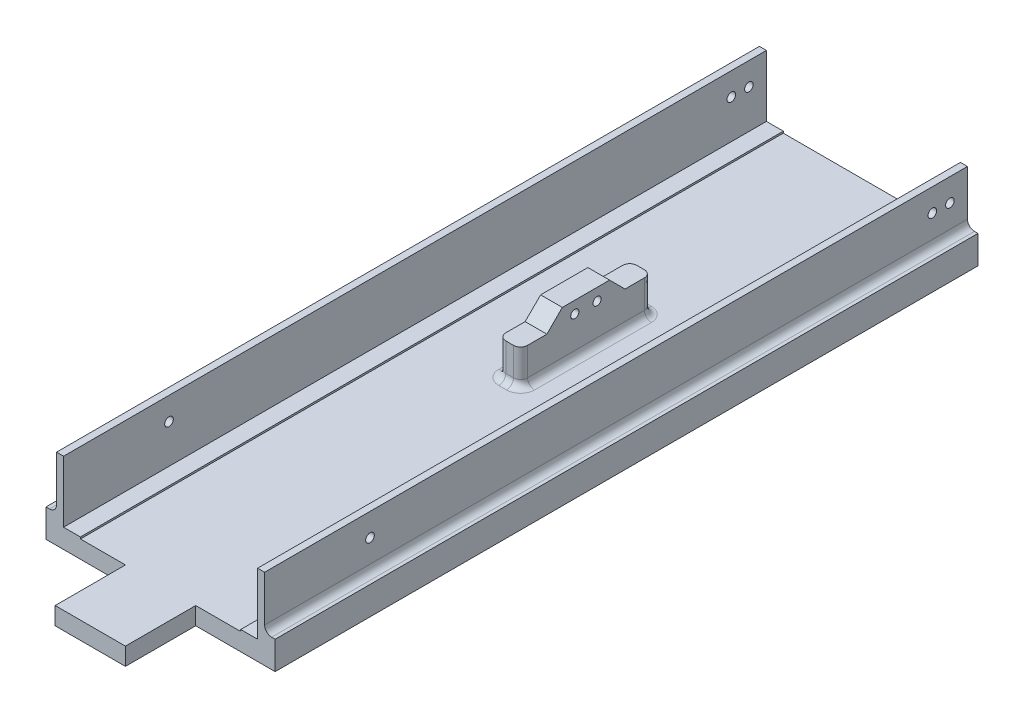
ISO-10303-21;
HEADER;
FILE_DESCRIPTION(('STEP AP214'),'2;1');
FILE_NAME('part.step','',(''),(''),'','','');
FILE_SCHEMA(('AUTOMOTIVE_DESIGN { 1 0 10303 214 1 1 1 1 }'));
ENDSEC;
DATA;
#1=APPLICATION_CONTEXT('core data for automotive mechanical design processes');
#2=APPLICATION_PROTOCOL_DEFINITION('international standard','automotive_design',2000,#1);
#3=PRODUCT_CONTEXT('',#1,'mechanical');
#4=PRODUCT('Part','Part','',(#3));
#5=PRODUCT_RELATED_PRODUCT_CATEGORY('part','',(#4));
#6=PRODUCT_DEFINITION_FORMATION('','',#4);
#7=PRODUCT_DEFINITION_CONTEXT('part definition',#1,'design');
#8=PRODUCT_DEFINITION('design','',#6,#7);
#9=PRODUCT_DEFINITION_SHAPE('','',#8);
#10=(LENGTH_UNIT() NAMED_UNIT(*) SI_UNIT(.MILLI.,.METRE.));
#11=(NAMED_UNIT(*) PLANE_ANGLE_UNIT() SI_UNIT($,.RADIAN.));
#12=(NAMED_UNIT(*) SI_UNIT($,.STERADIAN.) SOLID_ANGLE_UNIT());
#13=UNCERTAINTY_MEASURE_WITH_UNIT(LENGTH_MEASURE(1.E-05),#10,'distance_accuracy_value','');
#14=(GEOMETRIC_REPRESENTATION_CONTEXT(3) GLOBAL_UNCERTAINTY_ASSIGNED_CONTEXT((#13)) GLOBAL_UNIT_ASSIGNED_CONTEXT((#10,
#11,#12)) REPRESENTATION_CONTEXT('',''));
#15=CARTESIAN_POINT('',(0.,0.,0.));
#16=DIRECTION('',(0.,0.,1.));
#17=DIRECTION('',(1.,0.,0.));
#18=AXIS2_PLACEMENT_3D('',#15,#16,#17);
#19=CARTESIAN_POINT('',(9.8,13.,0.));
#20=DIRECTION('',(-1.,0.,0.));
#21=DIRECTION('',(0.,0.,1.));
#22=AXIS2_PLACEMENT_3D('',#19,#20,#21);
#23=PLANE('',#22);
#24=DIRECTION('',(0.,1.,0.));
#25=VECTOR('',#24,1.);
#26=CARTESIAN_POINT('',(9.80000000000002,13.,200.));
#27=LINE('',#26,#25);
#28=CARTESIAN_POINT('',(9.80000000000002,4.99999999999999,200.));
#29=VERTEX_POINT('',#28);
#30=CARTESIAN_POINT('',(9.80000000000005,5.49999999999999,200.));
#31=VERTEX_POINT('',#30);
#32=EDGE_CURVE('E344',#29,#31,#27,.T.);
#33=ORIENTED_EDGE('',*,*,#32,.F.);
#34=DIRECTION('',(0.,0.,-1.));
#35=VECTOR('',#34,1.);
#36=CARTESIAN_POINT('',(9.8,4.99999999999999,0.));
#37=LINE('',#36,#35);
#38=CARTESIAN_POINT('',(9.8,4.99999999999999,0.));
#39=VERTEX_POINT('',#38);
#40=EDGE_CURVE('E485',#29,#39,#37,.T.);
#41=ORIENTED_EDGE('',*,*,#40,.T.);
#42=DIRECTION('',(0.,-1.,0.));
#43=VECTOR('',#42,1.);
#44=CARTESIAN_POINT('',(9.8,13.,0.));
#45=LINE('',#44,#43);
#46=CARTESIAN_POINT('',(9.80000000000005,5.49999999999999,0.));
#47=VERTEX_POINT('',#46);
#48=EDGE_CURVE('E487',#47,#39,#45,.T.);
#49=ORIENTED_EDGE('',*,*,#48,.F.);
#50=DIRECTION('',(0.,0.,-1.));
#51=VECTOR('',#50,1.);
#52=CARTESIAN_POINT('',(9.80000000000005,5.49999999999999,0.));
#53=LINE('',#52,#51);
#54=EDGE_CURVE('E422',#31,#47,#53,.T.);
#55=ORIENTED_EDGE('',*,*,#54,.F.);
#56=EDGE_LOOP('',(#33,#41,#49,#55));
#57=FACE_BOUND('',#56,.T.);
#58=ADVANCED_FACE('F38',(#57),#23,.F.);
#59=CARTESIAN_POINT('',(5.,4.99999999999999,400.));
#60=DIRECTION('',(0.,-1.,0.));
#61=DIRECTION('',(0.,0.,-1.));
#62=AXIS2_PLACEMENT_3D('',#59,#60,#61);
#63=PLANE('',#62);
#64=CARTESIAN_POINT('',(33.69,4.99999999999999,65.42));
#65=DIRECTION('',(0.,-1.,0.));
#66=DIRECTION('',(0.,0.,-1.));
#67=AXIS2_PLACEMENT_3D('',#64,#65,#66);
#68=CIRCLE('',#67,4.);
#69=CARTESIAN_POINT('',(37.69,4.99999999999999,65.42));
#70=VERTEX_POINT('',#69);
#71=CARTESIAN_POINT('',(33.69,4.99999999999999,61.42));
#72=VERTEX_POINT('',#71);
#73=EDGE_CURVE('E568',#70,#72,#68,.F.);
#74=ORIENTED_EDGE('',*,*,#73,.F.);
#75=DIRECTION('',(0.,0.,-1.));
#76=VECTOR('',#75,1.);
#77=CARTESIAN_POINT('',(37.69,4.99999999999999,100.67));
#78=LINE('',#77,#76);
#79=CARTESIAN_POINT('',(37.69,4.99999999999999,98.67));
#80=VERTEX_POINT('',#79);
#81=EDGE_CURVE('E574',#70,#80,#78,.F.);
#82=ORIENTED_EDGE('',*,*,#81,.T.);
#83=CARTESIAN_POINT('',(33.69,4.99999999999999,98.67));
#84=DIRECTION('',(0.,-1.,0.));
#85=DIRECTION('',(0.,0.,-1.));
#86=AXIS2_PLACEMENT_3D('',#83,#84,#85);
#87=CIRCLE('',#86,4.);
#88=CARTESIAN_POINT('',(33.69,4.99999999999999,102.67));
#89=VERTEX_POINT('',#88);
#90=EDGE_CURVE('E571',#89,#80,#87,.F.);
#91=ORIENTED_EDGE('',*,*,#90,.F.);
#92=DIRECTION('',(1.,0.,0.));
#93=VECTOR('',#92,1.);
#94=CARTESIAN_POINT('',(29.51,4.99999999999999,102.67));
#95=LINE('',#94,#93);
#96=CARTESIAN_POINT('',(31.51,4.99999999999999,102.67));
#97=VERTEX_POINT('',#96);
#98=EDGE_CURVE('E565',#89,#97,#95,.F.);
#99=ORIENTED_EDGE('',*,*,#98,.T.);
#100=CARTESIAN_POINT('',(31.51,4.99999999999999,98.67));
#101=DIRECTION('',(0.,-1.,0.));
#102=DIRECTION('',(0.,0.,-1.));
#103=AXIS2_PLACEMENT_3D('',#100,#101,#102);
#104=CIRCLE('',#103,4.);
#105=CARTESIAN_POINT('',(27.51,4.99999999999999,98.67));
#106=VERTEX_POINT('',#105);
#107=EDGE_CURVE('E563',#106,#97,#104,.F.);
#108=ORIENTED_EDGE('',*,*,#107,.F.);
#109=DIRECTION('',(0.,0.,1.));
#110=VECTOR('',#109,1.);
#111=CARTESIAN_POINT('',(27.51,4.99999999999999,63.42));
#112=LINE('',#111,#110);
#113=CARTESIAN_POINT('',(27.51,4.99999999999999,65.42));
#114=VERTEX_POINT('',#113);
#115=EDGE_CURVE('E559',#106,#114,#112,.F.);
#116=ORIENTED_EDGE('',*,*,#115,.T.);
#117=CARTESIAN_POINT('',(31.51,4.99999999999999,65.42));
#118=DIRECTION('',(0.,-1.,0.));
#119=DIRECTION('',(0.,0.,-1.));
#120=AXIS2_PLACEMENT_3D('',#117,#118,#119);
#121=CIRCLE('',#120,4.);
#122=CARTESIAN_POINT('',(31.51,4.99999999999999,61.42));
#123=VERTEX_POINT('',#122);
#124=EDGE_CURVE('E556',#123,#114,#121,.F.);
#125=ORIENTED_EDGE('',*,*,#124,.F.);
#126=DIRECTION('',(-1.,0.,0.));
#127=VECTOR('',#126,1.);
#128=CARTESIAN_POINT('',(35.69,4.99999999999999,61.42));
#129=LINE('',#128,#127);
#130=EDGE_CURVE('E561',#123,#72,#129,.F.);
#131=ORIENTED_EDGE('',*,*,#130,.T.);
#132=EDGE_LOOP('',(#74,#82,#91,#99,#108,#116,#125,#131));
#133=FACE_BOUND('',#132,.T.);
#134=DIRECTION('',(-1.,0.,0.));
#135=VECTOR('',#134,1.);
#136=CARTESIAN_POINT('',(5.,4.99999999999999,200.));
#137=LINE('',#136,#135);
#138=CARTESIAN_POINT('',(55.4,4.99999999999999,200.));
#139=VERTEX_POINT('',#138);
#140=CARTESIAN_POINT('',(42.6,4.99999999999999,200.));
#141=VERTEX_POINT('',#140);
#142=EDGE_CURVE('E290',#139,#141,#137,.T.);
#143=ORIENTED_EDGE('',*,*,#142,.F.);
#144=DIRECTION('',(0.,0.,1.));
#145=VECTOR('',#144,1.);
#146=CARTESIAN_POINT('',(55.4,4.99999999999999,0.));
#147=LINE('',#146,#145);
#148=CARTESIAN_POINT('',(55.4,4.99999999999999,0.));
#149=VERTEX_POINT('',#148);
#150=EDGE_CURVE('E482',#149,#139,#147,.T.);
#151=ORIENTED_EDGE('',*,*,#150,.F.);
#152=DIRECTION('',(-1.,0.,0.));
#153=VECTOR('',#152,1.);
#154=CARTESIAN_POINT('',(5.,4.99999999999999,0.));
#155=LINE('',#154,#153);
#156=EDGE_CURVE('E503',#149,#39,#155,.T.);
#157=ORIENTED_EDGE('',*,*,#156,.T.);
#158=ORIENTED_EDGE('',*,*,#40,.F.);
#159=DIRECTION('',(-1.,0.,0.));
#160=VECTOR('',#159,1.);
#161=CARTESIAN_POINT('',(5.,4.99999999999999,200.));
#162=LINE('',#161,#160);
#163=CARTESIAN_POINT('',(22.6,4.99999999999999,200.));
#164=VERTEX_POINT('',#163);
#165=EDGE_CURVE('E346',#164,#29,#162,.T.);
#166=ORIENTED_EDGE('',*,*,#165,.F.);
#167=DIRECTION('',(0.,0.,-1.));
#168=VECTOR('',#167,1.);
#169=CARTESIAN_POINT('',(22.6,4.99999999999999,400.));
#170=LINE('',#169,#168);
#171=CARTESIAN_POINT('',(22.6,4.99999999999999,220.));
#172=VERTEX_POINT('',#171);
#173=EDGE_CURVE('E363',#172,#164,#170,.T.);
#174=ORIENTED_EDGE('',*,*,#173,.F.);
#175=DIRECTION('',(-1.,0.,0.));
#176=VECTOR('',#175,1.);
#177=CARTESIAN_POINT('',(5.,4.99999999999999,220.));
#178=LINE('',#177,#176);
#179=CARTESIAN_POINT('',(42.6,4.99999999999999,220.));
#180=VERTEX_POINT('',#179);
#181=EDGE_CURVE('E361',#180,#172,#178,.T.);
#182=ORIENTED_EDGE('',*,*,#181,.F.);
#183=DIRECTION('',(0.,0.,-1.));
#184=VECTOR('',#183,1.);
#185=CARTESIAN_POINT('',(42.6,4.99999999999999,400.));
#186=LINE('',#185,#184);
#187=EDGE_CURVE('E359',#180,#141,#186,.T.);
#188=ORIENTED_EDGE('',*,*,#187,.T.);
#189=EDGE_LOOP('',(#143,#151,#157,#158,#166,#174,#182,#188));
#190=FACE_BOUND('',#189,.T.);
#191=ADVANCED_FACE('F646',(#133,#190),#63,.F.);
#192=CARTESIAN_POINT('',(5.,25.,400.));
#193=DIRECTION('',(-1.,0.,0.));
#194=DIRECTION('',(0.,-1.,0.));
#195=AXIS2_PLACEMENT_3D('',#192,#193,#194);
#196=PLANE('',#195);
#197=CARTESIAN_POINT('',(5.,16.5,10.));
#198=DIRECTION('',(-1.,0.,0.));
#199=DIRECTION('',(0.,-1.,0.));
#200=AXIS2_PLACEMENT_3D('',#197,#198,#199);
#201=CIRCLE('',#200,1.225);
#202=CARTESIAN_POINT('',(5.,15.275,10.));
#203=VERTEX_POINT('',#202);
#204=EDGE_CURVE('E473',#203,#203,#201,.T.);
#205=ORIENTED_EDGE('',*,*,#204,.T.);
#206=EDGE_LOOP('',(#205));
#207=FACE_BOUND('',#206,.T.);
#208=CARTESIAN_POINT('',(5.,16.5,5.));
#209=DIRECTION('',(-1.,0.,0.));
#210=DIRECTION('',(0.,-1.,0.));
#211=AXIS2_PLACEMENT_3D('',#208,#209,#210);
#212=CIRCLE('',#211,1.225);
#213=CARTESIAN_POINT('',(5.,15.275,5.));
#214=VERTEX_POINT('',#213);
#215=EDGE_CURVE('E477',#214,#214,#212,.T.);
#216=ORIENTED_EDGE('',*,*,#215,.T.);
#217=EDGE_LOOP('',(#216));
#218=FACE_BOUND('',#217,.T.);
#219=CARTESIAN_POINT('',(5.,16.5,170.));
#220=DIRECTION('',(-1.,0.,0.));
#221=DIRECTION('',(0.,-1.,0.));
#222=AXIS2_PLACEMENT_3D('',#219,#220,#221);
#223=CIRCLE('',#222,1.225);
#224=CARTESIAN_POINT('',(5.,15.275,170.));
#225=VERTEX_POINT('',#224);
#226=EDGE_CURVE('E403',#225,#225,#223,.T.);
#227=ORIENTED_EDGE('',*,*,#226,.T.);
#228=EDGE_LOOP('',(#227));
#229=FACE_BOUND('',#228,.T.);
#230=DIRECTION('',(0.,1.,0.));
#231=VECTOR('',#230,1.);
#232=CARTESIAN_POINT('',(5.,25.,200.));
#233=LINE('',#232,#231);
#234=CARTESIAN_POINT('',(5.,5.49999999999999,200.));
#235=VERTEX_POINT('',#234);
#236=CARTESIAN_POINT('',(5.,23.,200.));
#237=VERTEX_POINT('',#236);
#238=EDGE_CURVE('E342',#235,#237,#233,.T.);
#239=ORIENTED_EDGE('',*,*,#238,.F.);
#240=DIRECTION('',(0.,0.,1.));
#241=VECTOR('',#240,1.);
#242=CARTESIAN_POINT('',(5.,5.49999999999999,0.));
#243=LINE('',#242,#241);
#244=CARTESIAN_POINT('',(5.,5.49999999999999,0.));
#245=VERTEX_POINT('',#244);
#246=EDGE_CURVE('E419',#245,#235,#243,.T.);
#247=ORIENTED_EDGE('',*,*,#246,.F.);
#248=DIRECTION('',(0.,1.,0.));
#249=VECTOR('',#248,1.);
#250=CARTESIAN_POINT('',(5.,25.,0.));
#251=LINE('',#250,#249);
#252=CARTESIAN_POINT('',(5.,23.,0.));
#253=VERTEX_POINT('',#252);
#254=EDGE_CURVE('E506',#245,#253,#251,.T.);
#255=ORIENTED_EDGE('',*,*,#254,.T.);
#256=DIRECTION('',(0.,0.,-1.));
#257=VECTOR('',#256,1.);
#258=CARTESIAN_POINT('',(5.,23.,400.));
#259=LINE('',#258,#257);
#260=EDGE_CURVE('E493',#237,#253,#259,.T.);
#261=ORIENTED_EDGE('',*,*,#260,.F.);
#262=EDGE_LOOP('',(#239,#247,#255,#261));
#263=FACE_BOUND('',#262,.T.);
#264=ADVANCED_FACE('F662',(#207,#218,#229,#263),#196,.F.);
#265=CARTESIAN_POINT('',(0.,0.,400.));
#266=DIRECTION('',(1.,0.,0.));
#267=DIRECTION('',(0.,0.,-1.));
#268=AXIS2_PLACEMENT_3D('',#265,#266,#267);
#269=PLANE('',#268);
#270=DIRECTION('',(0.,1.,0.));
#271=VECTOR('',#270,1.);
#272=CARTESIAN_POINT('',(0.,0.,200.));
#273=LINE('',#272,#271);
#274=CARTESIAN_POINT('',(0.,0.,200.));
#275=VERTEX_POINT('',#274);
#276=CARTESIAN_POINT('',(0.,7.99999999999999,200.));
#277=VERTEX_POINT('',#276);
#278=EDGE_CURVE('E329',#275,#277,#273,.T.);
#279=ORIENTED_EDGE('',*,*,#278,.T.);
#280=DIRECTION('',(0.,0.,-1.));
#281=VECTOR('',#280,1.);
#282=CARTESIAN_POINT('',(0.,7.99999999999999,400.));
#283=LINE('',#282,#281);
#284=CARTESIAN_POINT('',(0.,7.99999999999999,0.));
#285=VERTEX_POINT('',#284);
#286=EDGE_CURVE('E365',#277,#285,#283,.T.);
#287=ORIENTED_EDGE('',*,*,#286,.T.);
#288=DIRECTION('',(0.,-1.,0.));
#289=VECTOR('',#288,1.);
#290=CARTESIAN_POINT('',(0.,0.,0.));
#291=LINE('',#290,#289);
#292=CARTESIAN_POINT('',(0.,0.,0.));
#293=VERTEX_POINT('',#292);
#294=EDGE_CURVE('E509',#285,#293,#291,.T.);
#295=ORIENTED_EDGE('',*,*,#294,.T.);
#296=DIRECTION('',(0.,0.,-1.));
#297=VECTOR('',#296,1.);
#298=CARTESIAN_POINT('',(0.,0.,400.));
#299=LINE('',#298,#297);
#300=EDGE_CURVE('E512',#275,#293,#299,.T.);
#301=ORIENTED_EDGE('',*,*,#300,.F.);
#302=EDGE_LOOP('',(#279,#287,#295,#301));
#303=FACE_BOUND('',#302,.T.);
#304=ADVANCED_FACE('F638',(#303),#269,.F.);
#305=CARTESIAN_POINT('',(65.2,25.,400.));
#306=DIRECTION('',(-1.,0.,0.));
#307=DIRECTION('',(0.,0.,1.));
#308=AXIS2_PLACEMENT_3D('',#305,#306,#307);
#309=PLANE('',#308);
#310=DIRECTION('',(0.,1.,0.));
#311=VECTOR('',#310,1.);
#312=CARTESIAN_POINT('',(65.2,0.,200.));
#313=LINE('',#312,#311);
#314=CARTESIAN_POINT('',(65.2,0.,200.));
#315=VERTEX_POINT('',#314);
#316=CARTESIAN_POINT('',(65.2,7.99999999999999,200.));
#317=VERTEX_POINT('',#316);
#318=EDGE_CURVE('E326',#315,#317,#313,.T.);
#319=ORIENTED_EDGE('',*,*,#318,.F.);
#320=DIRECTION('',(0.,0.,-1.));
#321=VECTOR('',#320,1.);
#322=CARTESIAN_POINT('',(65.2,0.,400.));
#323=LINE('',#322,#321);
#324=CARTESIAN_POINT('',(65.2,0.,0.));
#325=VERTEX_POINT('',#324);
#326=EDGE_CURVE('E308',#315,#325,#323,.T.);
#327=ORIENTED_EDGE('',*,*,#326,.T.);
#328=DIRECTION('',(0.,1.,0.));
#329=VECTOR('',#328,1.);
#330=CARTESIAN_POINT('',(65.2,25.,0.));
#331=LINE('',#330,#329);
#332=CARTESIAN_POINT('',(65.2,7.99999999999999,0.));
#333=VERTEX_POINT('',#332);
#334=EDGE_CURVE('E497',#325,#333,#331,.T.);
#335=ORIENTED_EDGE('',*,*,#334,.T.);
#336=DIRECTION('',(0.,0.,-1.));
#337=VECTOR('',#336,1.);
#338=CARTESIAN_POINT('',(65.2,7.99999999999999,400.));
#339=LINE('',#338,#337);
#340=EDGE_CURVE('E373',#317,#333,#339,.T.);
#341=ORIENTED_EDGE('',*,*,#340,.F.);
#342=EDGE_LOOP('',(#319,#327,#335,#341));
#343=FACE_BOUND('',#342,.T.);
#344=ADVANCED_FACE('F704',(#343),#309,.F.);
#345=CARTESIAN_POINT('',(60.2,4.99999999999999,400.));
#346=DIRECTION('',(1.,0.,0.));
#347=DIRECTION('',(0.,0.,-1.));
#348=AXIS2_PLACEMENT_3D('',#345,#346,#347);
#349=PLANE('',#348);
#350=CARTESIAN_POINT('',(60.2,16.5,10.));
#351=DIRECTION('',(1.,0.,0.));
#352=DIRECTION('',(0.,0.,-1.));
#353=AXIS2_PLACEMENT_3D('',#350,#351,#352);
#354=CIRCLE('',#353,1.225);
#355=CARTESIAN_POINT('',(60.2,16.5,8.77500000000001));
#356=VERTEX_POINT('',#355);
#357=EDGE_CURVE('E472',#356,#356,#354,.T.);
#358=ORIENTED_EDGE('',*,*,#357,.T.);
#359=EDGE_LOOP('',(#358));
#360=FACE_BOUND('',#359,.T.);
#361=CARTESIAN_POINT('',(60.2,16.5,5.));
#362=DIRECTION('',(1.,0.,0.));
#363=DIRECTION('',(0.,0.,-1.));
#364=AXIS2_PLACEMENT_3D('',#361,#362,#363);
#365=CIRCLE('',#364,1.225);
#366=CARTESIAN_POINT('',(60.2,16.5,3.775));
#367=VERTEX_POINT('',#366);
#368=EDGE_CURVE('E476',#367,#367,#365,.T.);
#369=ORIENTED_EDGE('',*,*,#368,.T.);
#370=EDGE_LOOP('',(#369));
#371=FACE_BOUND('',#370,.T.);
#372=CARTESIAN_POINT('',(60.2,16.5,170.));
#373=DIRECTION('',(1.,0.,0.));
#374=DIRECTION('',(0.,0.,-1.));
#375=AXIS2_PLACEMENT_3D('',#372,#373,#374);
#376=CIRCLE('',#375,1.225);
#377=CARTESIAN_POINT('',(60.2,16.5,168.775));
#378=VERTEX_POINT('',#377);
#379=EDGE_CURVE('E402',#378,#378,#376,.T.);
#380=ORIENTED_EDGE('',*,*,#379,.T.);
#381=EDGE_LOOP('',(#380));
#382=FACE_BOUND('',#381,.T.);
#383=DIRECTION('',(0.,-1.,0.));
#384=VECTOR('',#383,1.);
#385=CARTESIAN_POINT('',(60.2,4.99999999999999,200.));
#386=LINE('',#385,#384);
#387=CARTESIAN_POINT('',(60.2,23.,200.));
#388=VERTEX_POINT('',#387);
#389=CARTESIAN_POINT('',(60.2,5.49999999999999,200.));
#390=VERTEX_POINT('',#389);
#391=EDGE_CURVE('E356',#388,#390,#386,.T.);
#392=ORIENTED_EDGE('',*,*,#391,.F.);
#393=DIRECTION('',(0.,0.,1.));
#394=VECTOR('',#393,1.);
#395=CARTESIAN_POINT('',(60.2,23.,400.));
#396=LINE('',#395,#394);
#397=CARTESIAN_POINT('',(60.2,23.,0.));
#398=VERTEX_POINT('',#397);
#399=EDGE_CURVE('E490',#398,#388,#396,.T.);
#400=ORIENTED_EDGE('',*,*,#399,.F.);
#401=DIRECTION('',(0.,-1.,0.));
#402=VECTOR('',#401,1.);
#403=CARTESIAN_POINT('',(60.2,4.99999999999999,0.));
#404=LINE('',#403,#402);
#405=CARTESIAN_POINT('',(60.2,5.49999999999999,0.));
#406=VERTEX_POINT('',#405);
#407=EDGE_CURVE('E500',#398,#406,#404,.T.);
#408=ORIENTED_EDGE('',*,*,#407,.T.);
#409=DIRECTION('',(0.,0.,-1.));
#410=VECTOR('',#409,1.);
#411=CARTESIAN_POINT('',(60.2,5.49999999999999,400.));
#412=LINE('',#411,#410);
#413=EDGE_CURVE('E430',#390,#406,#412,.T.);
#414=ORIENTED_EDGE('',*,*,#413,.F.);
#415=EDGE_LOOP('',(#392,#400,#408,#414));
#416=FACE_BOUND('',#415,.T.);
#417=ADVANCED_FACE('F708',(#360,#371,#382,#416),#349,.F.);
#418=CARTESIAN_POINT('',(65.2,0.,400.));
#419=DIRECTION('',(0.,1.,0.));
#420=DIRECTION('',(0.,0.,1.));
#421=AXIS2_PLACEMENT_3D('',#418,#419,#420);
#422=PLANE('',#421);
#423=DIRECTION('',(1.,0.,0.));
#424=VECTOR('',#423,1.);
#425=CARTESIAN_POINT('',(0.,0.,200.));
#426=LINE('',#425,#424);
#427=CARTESIAN_POINT('',(42.6,0.,200.));
#428=VERTEX_POINT('',#427);
#429=EDGE_CURVE('E287',#428,#315,#426,.T.);
#430=ORIENTED_EDGE('',*,*,#429,.F.);
#431=DIRECTION('',(0.,0.,1.));
#432=VECTOR('',#431,1.);
#433=CARTESIAN_POINT('',(42.6,0.,0.));
#434=LINE('',#433,#432);
#435=CARTESIAN_POINT('',(42.6,0.,220.));
#436=VERTEX_POINT('',#435);
#437=EDGE_CURVE('E298',#428,#436,#434,.T.);
#438=ORIENTED_EDGE('',*,*,#437,.T.);
#439=DIRECTION('',(1.,0.,0.));
#440=VECTOR('',#439,1.);
#441=CARTESIAN_POINT('',(0.,0.,220.));
#442=LINE('',#441,#440);
#443=CARTESIAN_POINT('',(22.6,0.,220.));
#444=VERTEX_POINT('',#443);
#445=EDGE_CURVE('E303',#444,#436,#442,.T.);
#446=ORIENTED_EDGE('',*,*,#445,.F.);
#447=DIRECTION('',(0.,0.,1.));
#448=VECTOR('',#447,1.);
#449=CARTESIAN_POINT('',(22.5999999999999,0.,0.));
#450=LINE('',#449,#448);
#451=CARTESIAN_POINT('',(22.6,0.,200.));
#452=VERTEX_POINT('',#451);
#453=EDGE_CURVE('E314',#452,#444,#450,.T.);
#454=ORIENTED_EDGE('',*,*,#453,.F.);
#455=EDGE_CURVE('E294',#275,#452,#426,.T.);
#456=ORIENTED_EDGE('',*,*,#455,.F.);
#457=ORIENTED_EDGE('',*,*,#300,.T.);
#458=DIRECTION('',(1.,0.,0.));
#459=VECTOR('',#458,1.);
#460=CARTESIAN_POINT('',(65.2,0.,0.));
#461=LINE('',#460,#459);
#462=EDGE_CURVE('E495',#293,#325,#461,.T.);
#463=ORIENTED_EDGE('',*,*,#462,.T.);
#464=ORIENTED_EDGE('',*,*,#326,.F.);
#465=EDGE_LOOP('',(#430,#438,#446,#454,#456,#457,#463,#464));
#466=FACE_BOUND('',#465,.T.);
#467=ADVANCED_FACE('F306',(#466),#422,.F.);
#468=CARTESIAN_POINT('',(0.,23.,0.));
#469=DIRECTION('',(0.,1.,0.));
#470=DIRECTION('',(0.,0.,1.));
#471=AXIS2_PLACEMENT_3D('',#468,#469,#470);
#472=PLANE('',#471);
#473=ORIENTED_EDGE('',*,*,#399,.T.);
#474=DIRECTION('',(1.,0.,0.));
#475=VECTOR('',#474,1.);
#476=CARTESIAN_POINT('',(0.,23.,200.));
#477=LINE('',#476,#475);
#478=CARTESIAN_POINT('',(62.2,23.,200.));
#479=VERTEX_POINT('',#478);
#480=EDGE_CURVE('E312',#388,#479,#477,.T.);
#481=ORIENTED_EDGE('',*,*,#480,.T.);
#482=DIRECTION('',(0.,0.,-1.));
#483=VECTOR('',#482,1.);
#484=CARTESIAN_POINT('',(62.2,23.,400.));
#485=LINE('',#484,#483);
#486=CARTESIAN_POINT('',(62.2,23.,0.));
#487=VERTEX_POINT('',#486);
#488=EDGE_CURVE('E374',#479,#487,#485,.T.);
#489=ORIENTED_EDGE('',*,*,#488,.T.);
#490=DIRECTION('',(1.,0.,0.));
#491=VECTOR('',#490,1.);
#492=CARTESIAN_POINT('',(0.,23.,0.));
#493=LINE('',#492,#491);
#494=EDGE_CURVE('E515',#398,#487,#493,.T.);
#495=ORIENTED_EDGE('',*,*,#494,.F.);
#496=EDGE_LOOP('',(#473,#481,#489,#495));
#497=FACE_BOUND('',#496,.T.);
#498=ADVANCED_FACE('F695',(#497),#472,.T.);
#499=DIRECTION('',(0.,0.,-1.));
#500=VECTOR('',#499,1.);
#501=CARTESIAN_POINT('',(3.,23.,400.));
#502=LINE('',#501,#500);
#503=CARTESIAN_POINT('',(3.,23.,200.));
#504=VERTEX_POINT('',#503);
#505=CARTESIAN_POINT('',(3.,23.,0.));
#506=VERTEX_POINT('',#505);
#507=EDGE_CURVE('E378',#504,#506,#502,.T.);
#508=ORIENTED_EDGE('',*,*,#507,.F.);
#509=EDGE_CURVE('E309',#504,#237,#477,.T.);
#510=ORIENTED_EDGE('',*,*,#509,.T.);
#511=ORIENTED_EDGE('',*,*,#260,.T.);
#512=EDGE_CURVE('E518',#506,#253,#493,.T.);
#513=ORIENTED_EDGE('',*,*,#512,.F.);
#514=EDGE_LOOP('',(#508,#510,#511,#513));
#515=FACE_BOUND('',#514,.T.);
#516=ADVANCED_FACE('F665',(#515),#472,.T.);
#517=CARTESIAN_POINT('',(55.4,13.,0.));
#518=DIRECTION('',(1.,0.,0.));
#519=DIRECTION('',(0.,0.,-1.));
#520=AXIS2_PLACEMENT_3D('',#517,#518,#519);
#521=PLANE('',#520);
#522=DIRECTION('',(0.,-1.,0.));
#523=VECTOR('',#522,1.);
#524=CARTESIAN_POINT('',(55.4,13.,200.));
#525=LINE('',#524,#523);
#526=CARTESIAN_POINT('',(55.4,5.49999999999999,200.));
#527=VERTEX_POINT('',#526);
#528=EDGE_CURVE('E354',#527,#139,#525,.T.);
#529=ORIENTED_EDGE('',*,*,#528,.F.);
#530=DIRECTION('',(0.,0.,1.));
#531=VECTOR('',#530,1.);
#532=CARTESIAN_POINT('',(55.4,5.49999999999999,400.));
#533=LINE('',#532,#531);
#534=CARTESIAN_POINT('',(55.4,5.49999999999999,0.));
#535=VERTEX_POINT('',#534);
#536=EDGE_CURVE('E423',#535,#527,#533,.T.);
#537=ORIENTED_EDGE('',*,*,#536,.F.);
#538=DIRECTION('',(0.,-1.,0.));
#539=VECTOR('',#538,1.);
#540=CARTESIAN_POINT('',(55.4,13.,0.));
#541=LINE('',#540,#539);
#542=EDGE_CURVE('E480',#535,#149,#541,.T.);
#543=ORIENTED_EDGE('',*,*,#542,.T.);
#544=ORIENTED_EDGE('',*,*,#150,.T.);
#545=EDGE_LOOP('',(#529,#537,#543,#544));
#546=FACE_BOUND('',#545,.T.);
#547=ADVANCED_FACE('F693',(#546),#521,.F.);
#548=CARTESIAN_POINT('',(0.,5.49999999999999,0.));
#549=DIRECTION('',(0.,1.,0.));
#550=DIRECTION('',(0.,0.,1.));
#551=AXIS2_PLACEMENT_3D('',#548,#549,#550);
#552=PLANE('',#551);
#553=ORIENTED_EDGE('',*,*,#246,.T.);
#554=DIRECTION('',(1.,0.,0.));
#555=VECTOR('',#554,1.);
#556=CARTESIAN_POINT('',(0.,5.49999999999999,200.));
#557=LINE('',#556,#555);
#558=EDGE_CURVE('E339',#235,#31,#557,.T.);
#559=ORIENTED_EDGE('',*,*,#558,.T.);
#560=ORIENTED_EDGE('',*,*,#54,.T.);
#561=DIRECTION('',(-1.,0.,0.));
#562=VECTOR('',#561,1.);
#563=CARTESIAN_POINT('',(5.,5.49999999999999,0.));
#564=LINE('',#563,#562);
#565=EDGE_CURVE('E425',#47,#245,#564,.T.);
#566=ORIENTED_EDGE('',*,*,#565,.T.);
#567=EDGE_LOOP('',(#553,#559,#560,#566));
#568=FACE_BOUND('',#567,.T.);
#569=ADVANCED_FACE('F654',(#568),#552,.T.);
#570=CARTESIAN_POINT('',(0.,5.49999999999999,0.));
#571=DIRECTION('',(0.,-1.,0.));
#572=DIRECTION('',(0.,0.,-1.));
#573=AXIS2_PLACEMENT_3D('',#570,#571,#572);
#574=PLANE('',#573);
#575=DIRECTION('',(-1.,0.,0.));
#576=VECTOR('',#575,1.);
#577=CARTESIAN_POINT('',(0.,5.49999999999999,200.));
#578=LINE('',#577,#576);
#579=EDGE_CURVE('E352',#390,#527,#578,.T.);
#580=ORIENTED_EDGE('',*,*,#579,.F.);
#581=ORIENTED_EDGE('',*,*,#413,.T.);
#582=DIRECTION('',(-1.,0.,0.));
#583=VECTOR('',#582,1.);
#584=CARTESIAN_POINT('',(55.4,5.49999999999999,0.));
#585=LINE('',#584,#583);
#586=EDGE_CURVE('E414',#406,#535,#585,.T.);
#587=ORIENTED_EDGE('',*,*,#586,.T.);
#588=ORIENTED_EDGE('',*,*,#536,.T.);
#589=EDGE_LOOP('',(#580,#581,#587,#588));
#590=FACE_BOUND('',#589,.T.);
#591=ADVANCED_FACE('F669',(#590),#574,.F.);
#592=CARTESIAN_POINT('',(3.,23.,400.));
#593=DIRECTION('',(1.,0.,0.));
#594=DIRECTION('',(0.,1.,0.));
#595=AXIS2_PLACEMENT_3D('',#592,#593,#594);
#596=PLANE('',#595);
#597=CARTESIAN_POINT('',(3.,16.5,10.));
#598=DIRECTION('',(1.,0.,0.));
#599=DIRECTION('',(0.,1.,0.));
#600=AXIS2_PLACEMENT_3D('',#597,#598,#599);
#601=CIRCLE('',#600,1.225);
#602=CARTESIAN_POINT('',(3.,17.725,10.));
#603=VERTEX_POINT('',#602);
#604=EDGE_CURVE('E390',#603,#603,#601,.F.);
#605=ORIENTED_EDGE('',*,*,#604,.F.);
#606=EDGE_LOOP('',(#605));
#607=FACE_BOUND('',#606,.T.);
#608=CARTESIAN_POINT('',(3.,16.5,170.));
#609=DIRECTION('',(1.,0.,0.));
#610=DIRECTION('',(0.,1.,0.));
#611=AXIS2_PLACEMENT_3D('',#608,#609,#610);
#612=CIRCLE('',#611,1.225);
#613=CARTESIAN_POINT('',(3.,17.725,170.));
#614=VERTEX_POINT('',#613);
#615=EDGE_CURVE('E376',#614,#614,#612,.F.);
#616=ORIENTED_EDGE('',*,*,#615,.F.);
#617=EDGE_LOOP('',(#616));
#618=FACE_BOUND('',#617,.T.);
#619=CARTESIAN_POINT('',(3.,16.5,5.));
#620=DIRECTION('',(1.,0.,0.));
#621=DIRECTION('',(0.,1.,0.));
#622=AXIS2_PLACEMENT_3D('',#619,#620,#621);
#623=CIRCLE('',#622,1.225);
#624=CARTESIAN_POINT('',(3.,17.725,5.));
#625=VERTEX_POINT('',#624);
#626=EDGE_CURVE('E387',#625,#625,#623,.F.);
#627=ORIENTED_EDGE('',*,*,#626,.F.);
#628=EDGE_LOOP('',(#627));
#629=FACE_BOUND('',#628,.T.);
#630=DIRECTION('',(0.,-1.,0.));
#631=VECTOR('',#630,1.);
#632=CARTESIAN_POINT('',(3.,23.,200.));
#633=LINE('',#632,#631);
#634=CARTESIAN_POINT('',(3.,9.99999999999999,200.));
#635=VERTEX_POINT('',#634);
#636=EDGE_CURVE('E53',#504,#635,#633,.T.);
#637=ORIENTED_EDGE('',*,*,#636,.F.);
#638=ORIENTED_EDGE('',*,*,#507,.T.);
#639=DIRECTION('',(0.,-1.,0.));
#640=VECTOR('',#639,1.);
#641=CARTESIAN_POINT('',(3.,23.,0.));
#642=LINE('',#641,#640);
#643=CARTESIAN_POINT('',(3.,9.99999999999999,0.));
#644=VERTEX_POINT('',#643);
#645=EDGE_CURVE('E370',#506,#644,#642,.T.);
#646=ORIENTED_EDGE('',*,*,#645,.T.);
#647=DIRECTION('',(0.,0.,-1.));
#648=VECTOR('',#647,1.);
#649=CARTESIAN_POINT('',(3.,9.99999999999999,400.));
#650=LINE('',#649,#648);
#651=EDGE_CURVE('E620',#644,#635,#650,.F.);
#652=ORIENTED_EDGE('',*,*,#651,.T.);
#653=EDGE_LOOP('',(#637,#638,#646,#652));
#654=FACE_BOUND('',#653,.T.);
#655=ADVANCED_FACE('F667',(#607,#618,#629,#654),#596,.F.);
#656=CARTESIAN_POINT('',(0.,7.99999999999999,400.));
#657=DIRECTION('',(0.,-1.,0.));
#658=DIRECTION('',(0.,0.,-1.));
#659=AXIS2_PLACEMENT_3D('',#656,#657,#658);
#660=PLANE('',#659);
#661=DIRECTION('',(-1.,0.,0.));
#662=VECTOR('',#661,1.);
#663=CARTESIAN_POINT('',(0.,7.99999999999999,200.));
#664=LINE('',#663,#662);
#665=CARTESIAN_POINT('',(0.999999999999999,7.99999999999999,200.));
#666=VERTEX_POINT('',#665);
#667=EDGE_CURVE('E328',#666,#277,#664,.T.);
#668=ORIENTED_EDGE('',*,*,#667,.F.);
#669=DIRECTION('',(0.,0.,-1.));
#670=VECTOR('',#669,1.);
#671=CARTESIAN_POINT('',(0.999999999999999,7.99999999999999,0.));
#672=LINE('',#671,#670);
#673=CARTESIAN_POINT('',(0.999999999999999,7.99999999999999,0.));
#674=VERTEX_POINT('',#673);
#675=EDGE_CURVE('E618',#666,#674,#672,.T.);
#676=ORIENTED_EDGE('',*,*,#675,.T.);
#677=DIRECTION('',(-1.,0.,0.));
#678=VECTOR('',#677,1.);
#679=CARTESIAN_POINT('',(0.,7.99999999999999,0.));
#680=LINE('',#679,#678);
#681=EDGE_CURVE('E380',#674,#285,#680,.T.);
#682=ORIENTED_EDGE('',*,*,#681,.T.);
#683=ORIENTED_EDGE('',*,*,#286,.F.);
#684=EDGE_LOOP('',(#668,#676,#682,#683));
#685=FACE_BOUND('',#684,.T.);
#686=ADVANCED_FACE('F630',(#685),#660,.F.);
#687=CARTESIAN_POINT('',(62.2,23.,400.));
#688=DIRECTION('',(-1.,0.,0.));
#689=DIRECTION('',(0.,0.,1.));
#690=AXIS2_PLACEMENT_3D('',#687,#688,#689);
#691=PLANE('',#690);
#692=CARTESIAN_POINT('',(62.2,16.5,10.));
#693=DIRECTION('',(-1.,0.,0.));
#694=DIRECTION('',(0.,0.,1.));
#695=AXIS2_PLACEMENT_3D('',#692,#693,#694);
#696=CIRCLE('',#695,1.225);
#697=CARTESIAN_POINT('',(62.2,16.5,11.225));
#698=VERTEX_POINT('',#697);
#699=EDGE_CURVE('E399',#698,#698,#696,.F.);
#700=ORIENTED_EDGE('',*,*,#699,.F.);
#701=EDGE_LOOP('',(#700));
#702=FACE_BOUND('',#701,.T.);
#703=CARTESIAN_POINT('',(62.2,16.5,170.));
#704=DIRECTION('',(-1.,0.,0.));
#705=DIRECTION('',(0.,0.,1.));
#706=AXIS2_PLACEMENT_3D('',#703,#704,#705);
#707=CIRCLE('',#706,1.225);
#708=CARTESIAN_POINT('',(62.2,16.5,171.225));
#709=VERTEX_POINT('',#708);
#710=EDGE_CURVE('E393',#709,#709,#707,.F.);
#711=ORIENTED_EDGE('',*,*,#710,.F.);
#712=EDGE_LOOP('',(#711));
#713=FACE_BOUND('',#712,.T.);
#714=CARTESIAN_POINT('',(62.2,16.5,5.));
#715=DIRECTION('',(-1.,0.,0.));
#716=DIRECTION('',(0.,0.,1.));
#717=AXIS2_PLACEMENT_3D('',#714,#715,#716);
#718=CIRCLE('',#717,1.225);
#719=CARTESIAN_POINT('',(62.2,16.5,6.225));
#720=VERTEX_POINT('',#719);
#721=EDGE_CURVE('E396',#720,#720,#718,.F.);
#722=ORIENTED_EDGE('',*,*,#721,.F.);
#723=EDGE_LOOP('',(#722));
#724=FACE_BOUND('',#723,.T.);
#725=DIRECTION('',(0.,1.,0.));
#726=VECTOR('',#725,1.);
#727=CARTESIAN_POINT('',(62.2,23.,200.));
#728=LINE('',#727,#726);
#729=CARTESIAN_POINT('',(62.2,9.99999999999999,200.));
#730=VERTEX_POINT('',#729);
#731=EDGE_CURVE('E350',#730,#479,#728,.T.);
#732=ORIENTED_EDGE('',*,*,#731,.F.);
#733=DIRECTION('',(0.,0.,-1.));
#734=VECTOR('',#733,1.);
#735=CARTESIAN_POINT('',(62.2,9.99999999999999,0.));
#736=LINE('',#735,#734);
#737=CARTESIAN_POINT('',(62.2,9.99999999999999,0.));
#738=VERTEX_POINT('',#737);
#739=EDGE_CURVE('E576',#730,#738,#736,.T.);
#740=ORIENTED_EDGE('',*,*,#739,.T.);
#741=DIRECTION('',(0.,1.,0.));
#742=VECTOR('',#741,1.);
#743=CARTESIAN_POINT('',(62.2,23.,0.));
#744=LINE('',#743,#742);
#745=EDGE_CURVE('E369',#738,#487,#744,.T.);
#746=ORIENTED_EDGE('',*,*,#745,.T.);
#747=ORIENTED_EDGE('',*,*,#488,.F.);
#748=EDGE_LOOP('',(#732,#740,#746,#747));
#749=FACE_BOUND('',#748,.T.);
#750=ADVANCED_FACE('F676',(#702,#713,#724,#749),#691,.F.);
#751=CARTESIAN_POINT('',(65.2,7.99999999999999,400.));
#752=DIRECTION('',(0.,-1.,0.));
#753=DIRECTION('',(0.,0.,-1.));
#754=AXIS2_PLACEMENT_3D('',#751,#752,#753);
#755=PLANE('',#754);
#756=DIRECTION('',(-1.,0.,0.));
#757=VECTOR('',#756,1.);
#758=CARTESIAN_POINT('',(65.2,7.99999999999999,200.));
#759=LINE('',#758,#757);
#760=CARTESIAN_POINT('',(64.2,7.99999999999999,200.));
#761=VERTEX_POINT('',#760);
#762=EDGE_CURVE('E348',#317,#761,#759,.T.);
#763=ORIENTED_EDGE('',*,*,#762,.F.);
#764=ORIENTED_EDGE('',*,*,#340,.T.);
#765=DIRECTION('',(-1.,0.,0.));
#766=VECTOR('',#765,1.);
#767=CARTESIAN_POINT('',(65.2,7.99999999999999,0.));
#768=LINE('',#767,#766);
#769=CARTESIAN_POINT('',(64.2,7.99999999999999,0.));
#770=VERTEX_POINT('',#769);
#771=EDGE_CURVE('E366',#333,#770,#768,.T.);
#772=ORIENTED_EDGE('',*,*,#771,.T.);
#773=DIRECTION('',(0.,0.,-1.));
#774=VECTOR('',#773,1.);
#775=CARTESIAN_POINT('',(64.2,7.99999999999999,400.));
#776=LINE('',#775,#774);
#777=EDGE_CURVE('E613',#770,#761,#776,.F.);
#778=ORIENTED_EDGE('',*,*,#777,.T.);
#779=EDGE_LOOP('',(#763,#764,#772,#778));
#780=FACE_BOUND('',#779,.T.);
#781=ADVANCED_FACE('F768',(#780),#755,.F.);
#782=CARTESIAN_POINT('',(64.2,9.99999999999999,400.));
#783=DIRECTION('',(0.,0.,1.));
#784=DIRECTION('',(1.,0.,0.));
#785=AXIS2_PLACEMENT_3D('',#782,#783,#784);
#786=CYLINDRICAL_SURFACE('',#785,2.);
#787=CARTESIAN_POINT('',(64.2,9.99999999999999,200.));
#788=DIRECTION('',(0.,0.,1.));
#789=DIRECTION('',(1.,0.,0.));
#790=AXIS2_PLACEMENT_3D('',#787,#788,#789);
#791=CIRCLE('',#790,2.);
#792=EDGE_CURVE('E11',#761,#730,#791,.F.);
#793=ORIENTED_EDGE('',*,*,#792,.F.);
#794=ORIENTED_EDGE('',*,*,#777,.F.);
#795=CARTESIAN_POINT('',(64.2,9.99999999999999,0.));
#796=DIRECTION('',(0.,0.,-1.));
#797=DIRECTION('',(-1.,0.,0.));
#798=AXIS2_PLACEMENT_3D('',#795,#796,#797);
#799=CIRCLE('',#798,2.);
#800=EDGE_CURVE('E616',#738,#770,#799,.F.);
#801=ORIENTED_EDGE('',*,*,#800,.F.);
#802=ORIENTED_EDGE('',*,*,#739,.F.);
#803=EDGE_LOOP('',(#793,#794,#801,#802));
#804=FACE_BOUND('',#803,.T.);
#805=ADVANCED_FACE('F766',(#804),#786,.F.);
#806=CARTESIAN_POINT('',(0.999999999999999,9.99999999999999,400.));
#807=DIRECTION('',(0.,0.,1.));
#808=DIRECTION('',(1.,0.,0.));
#809=AXIS2_PLACEMENT_3D('',#806,#807,#808);
#810=CYLINDRICAL_SURFACE('',#809,2.);
#811=CARTESIAN_POINT('',(0.999999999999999,9.99999999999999,200.));
#812=DIRECTION('',(0.,0.,1.));
#813=DIRECTION('',(1.,0.,0.));
#814=AXIS2_PLACEMENT_3D('',#811,#812,#813);
#815=CIRCLE('',#814,2.);
#816=EDGE_CURVE('E46',#635,#666,#815,.F.);
#817=ORIENTED_EDGE('',*,*,#816,.F.);
#818=ORIENTED_EDGE('',*,*,#651,.F.);
#819=CARTESIAN_POINT('',(0.999999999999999,9.99999999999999,0.));
#820=DIRECTION('',(0.,0.,-1.));
#821=DIRECTION('',(-1.,0.,0.));
#822=AXIS2_PLACEMENT_3D('',#819,#820,#821);
#823=CIRCLE('',#822,2.);
#824=EDGE_CURVE('E61',#674,#644,#823,.F.);
#825=ORIENTED_EDGE('',*,*,#824,.F.);
#826=ORIENTED_EDGE('',*,*,#675,.F.);
#827=EDGE_LOOP('',(#817,#818,#825,#826));
#828=FACE_BOUND('',#827,.T.);
#829=ADVANCED_FACE('F40',(#828),#810,.F.);
#830=CARTESIAN_POINT('',(32.6,15.,96.92));
#831=DIRECTION('',(0.,-1.,0.));
#832=DIRECTION('',(0.,0.,-1.));
#833=AXIS2_PLACEMENT_3D('',#830,#831,#832);
#834=PLANE('',#833);
#835=DIRECTION('',(0.,0.,-1.));
#836=VECTOR('',#835,1.);
#837=CARTESIAN_POINT('',(35.69,15.,63.42));
#838=LINE('',#837,#836);
#839=CARTESIAN_POINT('',(35.69,15.,70.92));
#840=VERTEX_POINT('',#839);
#841=CARTESIAN_POINT('',(35.69,15.,65.42));
#842=VERTEX_POINT('',#841);
#843=EDGE_CURVE('E466',#840,#842,#838,.T.);
#844=ORIENTED_EDGE('',*,*,#843,.T.);
#845=CARTESIAN_POINT('',(33.69,15.,65.42));
#846=DIRECTION('',(0.,-1.,0.));
#847=DIRECTION('',(0.,0.,-1.));
#848=AXIS2_PLACEMENT_3D('',#845,#846,#847);
#849=CIRCLE('',#848,2.);
#850=CARTESIAN_POINT('',(33.69,15.,63.42));
#851=VERTEX_POINT('',#850);
#852=EDGE_CURVE('E554',#842,#851,#849,.F.);
#853=ORIENTED_EDGE('',*,*,#852,.T.);
#854=DIRECTION('',(-1.,0.,0.));
#855=VECTOR('',#854,1.);
#856=CARTESIAN_POINT('',(29.51,15.,63.42));
#857=LINE('',#856,#855);
#858=CARTESIAN_POINT('',(31.51,15.,63.42));
#859=VERTEX_POINT('',#858);
#860=EDGE_CURVE('E469',#851,#859,#857,.T.);
#861=ORIENTED_EDGE('',*,*,#860,.T.);
#862=CARTESIAN_POINT('',(31.51,15.,65.42));
#863=DIRECTION('',(0.,-1.,0.));
#864=DIRECTION('',(0.,0.,-1.));
#865=AXIS2_PLACEMENT_3D('',#862,#863,#864);
#866=CIRCLE('',#865,2.);
#867=CARTESIAN_POINT('',(29.51,15.,65.42));
#868=VERTEX_POINT('',#867);
#869=EDGE_CURVE('E552',#859,#868,#866,.F.);
#870=ORIENTED_EDGE('',*,*,#869,.T.);
#871=DIRECTION('',(0.,0.,1.));
#872=VECTOR('',#871,1.);
#873=CARTESIAN_POINT('',(29.51,15.,63.42));
#874=LINE('',#873,#872);
#875=CARTESIAN_POINT('',(29.51,15.,70.92));
#876=VERTEX_POINT('',#875);
#877=EDGE_CURVE('E461',#868,#876,#874,.T.);
#878=ORIENTED_EDGE('',*,*,#877,.T.);
#879=DIRECTION('',(-1.,0.,0.));
#880=VECTOR('',#879,1.);
#881=CARTESIAN_POINT('',(58.370884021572,15.,70.92));
#882=LINE('',#881,#880);
#883=EDGE_CURVE('E437',#840,#876,#882,.T.);
#884=ORIENTED_EDGE('',*,*,#883,.F.);
#885=EDGE_LOOP('',(#844,#853,#861,#870,#878,#884));
#886=FACE_BOUND('',#885,.T.);
#887=ADVANCED_FACE('F701',(#886),#834,.F.);
#888=CARTESIAN_POINT('',(0.,0.,0.));
#889=DIRECTION('',(0.,0.,-1.));
#890=DIRECTION('',(-1.,0.,0.));
#891=AXIS2_PLACEMENT_3D('',#888,#889,#890);
#892=PLANE('',#891);
#893=ORIENTED_EDGE('',*,*,#745,.F.);
#894=ORIENTED_EDGE('',*,*,#800,.T.);
#895=ORIENTED_EDGE('',*,*,#771,.F.);
#896=ORIENTED_EDGE('',*,*,#334,.F.);
#897=ORIENTED_EDGE('',*,*,#462,.F.);
#898=ORIENTED_EDGE('',*,*,#294,.F.);
#899=ORIENTED_EDGE('',*,*,#681,.F.);
#900=ORIENTED_EDGE('',*,*,#824,.T.);
#901=ORIENTED_EDGE('',*,*,#645,.F.);
#902=ORIENTED_EDGE('',*,*,#512,.T.);
#903=ORIENTED_EDGE('',*,*,#254,.F.);
#904=ORIENTED_EDGE('',*,*,#565,.F.);
#905=ORIENTED_EDGE('',*,*,#48,.T.);
#906=ORIENTED_EDGE('',*,*,#156,.F.);
#907=ORIENTED_EDGE('',*,*,#542,.F.);
#908=ORIENTED_EDGE('',*,*,#586,.F.);
#909=ORIENTED_EDGE('',*,*,#407,.F.);
#910=ORIENTED_EDGE('',*,*,#494,.T.);
#911=EDGE_LOOP('',(#893,#894,#895,#896,#897,#898,#899,#900,#901,#902,#903,#904,#905,#906,#907,
#908,#909,#910));
#912=FACE_BOUND('',#911,.T.);
#913=ADVANCED_FACE('F633',(#912),#892,.T.);
#914=CARTESIAN_POINT('',(65.2,16.5,10.));
#915=DIRECTION('',(-1.,0.,0.));
#916=DIRECTION('',(0.,0.,1.));
#917=AXIS2_PLACEMENT_3D('',#914,#915,#916);
#918=CYLINDRICAL_SURFACE('',#917,1.225);
#919=ORIENTED_EDGE('',*,*,#699,.T.);
#920=EDGE_LOOP('',(#919));
#921=FACE_BOUND('',#920,.T.);
#922=ORIENTED_EDGE('',*,*,#357,.F.);
#923=EDGE_LOOP('',(#922));
#924=FACE_BOUND('',#923,.T.);
#925=ADVANCED_FACE('F700',(#921,#924),#918,.F.);
#926=CARTESIAN_POINT('',(65.2,16.5,5.));
#927=DIRECTION('',(-1.,0.,0.));
#928=DIRECTION('',(0.,0.,1.));
#929=AXIS2_PLACEMENT_3D('',#926,#927,#928);
#930=CYLINDRICAL_SURFACE('',#929,1.225);
#931=ORIENTED_EDGE('',*,*,#721,.T.);
#932=EDGE_LOOP('',(#931));
#933=FACE_BOUND('',#932,.T.);
#934=ORIENTED_EDGE('',*,*,#368,.F.);
#935=EDGE_LOOP('',(#934));
#936=FACE_BOUND('',#935,.T.);
#937=ADVANCED_FACE('F1030',(#933,#936),#930,.F.);
#938=ORIENTED_EDGE('',*,*,#604,.T.);
#939=EDGE_LOOP('',(#938));
#940=FACE_BOUND('',#939,.T.);
#941=ORIENTED_EDGE('',*,*,#204,.F.);
#942=EDGE_LOOP('',(#941));
#943=FACE_BOUND('',#942,.T.);
#944=ADVANCED_FACE('F1032',(#940,#943),#918,.F.);
#945=ORIENTED_EDGE('',*,*,#626,.T.);
#946=EDGE_LOOP('',(#945));
#947=FACE_BOUND('',#946,.T.);
#948=ORIENTED_EDGE('',*,*,#215,.F.);
#949=EDGE_LOOP('',(#948));
#950=FACE_BOUND('',#949,.T.);
#951=ADVANCED_FACE('F1042',(#947,#950),#930,.F.);
#952=CARTESIAN_POINT('',(29.51,15.,63.42));
#953=DIRECTION('',(1.,0.,0.));
#954=DIRECTION('',(0.,0.,-1.));
#955=AXIS2_PLACEMENT_3D('',#952,#953,#954);
#956=PLANE('',#955);
#957=CARTESIAN_POINT('',(29.51,16.,78.87));
#958=DIRECTION('',(-1.,0.,0.));
#959=DIRECTION('',(0.,0.,1.));
#960=AXIS2_PLACEMENT_3D('',#957,#958,#959);
#961=CIRCLE('',#960,1.16);
#962=CARTESIAN_POINT('',(29.51,16.,80.03));
#963=VERTEX_POINT('',#962);
#964=EDGE_CURVE('E410',#963,#963,#961,.T.);
#965=ORIENTED_EDGE('',*,*,#964,.F.);
#966=EDGE_LOOP('',(#965));
#967=FACE_BOUND('',#966,.T.);
#968=CARTESIAN_POINT('',(29.51,16.,85.22));
#969=DIRECTION('',(-1.,0.,0.));
#970=DIRECTION('',(0.,0.,1.));
#971=AXIS2_PLACEMENT_3D('',#968,#969,#970);
#972=CIRCLE('',#971,1.16);
#973=CARTESIAN_POINT('',(29.51,16.,86.38));
#974=VERTEX_POINT('',#973);
#975=EDGE_CURVE('E406',#974,#974,#972,.T.);
#976=ORIENTED_EDGE('',*,*,#975,.F.);
#977=EDGE_LOOP('',(#976));
#978=FACE_BOUND('',#977,.T.);
#979=DIRECTION('',(0.,0.,1.));
#980=VECTOR('',#979,1.);
#981=CARTESIAN_POINT('',(29.51,6.99999999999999,100.67));
#982=LINE('',#981,#980);
#983=CARTESIAN_POINT('',(29.51,6.99999999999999,65.42));
#984=VERTEX_POINT('',#983);
#985=CARTESIAN_POINT('',(29.51,6.99999999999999,98.67));
#986=VERTEX_POINT('',#985);
#987=EDGE_CURVE('E530',#984,#986,#982,.T.);
#988=ORIENTED_EDGE('',*,*,#987,.T.);
#989=DIRECTION('',(0.,-1.,0.));
#990=VECTOR('',#989,1.);
#991=CARTESIAN_POINT('',(29.51,15.,98.67));
#992=LINE('',#991,#990);
#993=CARTESIAN_POINT('',(29.51,15.,98.67));
#994=VERTEX_POINT('',#993);
#995=EDGE_CURVE('E534',#986,#994,#992,.F.);
#996=ORIENTED_EDGE('',*,*,#995,.T.);
#997=CARTESIAN_POINT('',(29.51,15.,93.17));
#998=VERTEX_POINT('',#997);
#999=EDGE_CURVE('E460',#998,#994,#874,.T.);
#1000=ORIENTED_EDGE('',*,*,#999,.F.);
#1001=DIRECTION('',(0.,0.707106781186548,-0.707106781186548));
#1002=VECTOR('',#1001,1.);
#1003=CARTESIAN_POINT('',(29.51,19.4,88.77));
#1004=LINE('',#1003,#1002);
#1005=CARTESIAN_POINT('',(29.51,19.4,88.77));
#1006=VERTEX_POINT('',#1005);
#1007=EDGE_CURVE('E440',#998,#1006,#1004,.T.);
#1008=ORIENTED_EDGE('',*,*,#1007,.T.);
#1009=DIRECTION('',(0.,0.,-1.));
#1010=VECTOR('',#1009,1.);
#1011=CARTESIAN_POINT('',(29.51,19.4,75.32));
#1012=LINE('',#1011,#1010);
#1013=CARTESIAN_POINT('',(29.51,19.4,75.32));
#1014=VERTEX_POINT('',#1013);
#1015=EDGE_CURVE('E443',#1006,#1014,#1012,.T.);
#1016=ORIENTED_EDGE('',*,*,#1015,.T.);
#1017=DIRECTION('',(0.,-0.707106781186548,-0.707106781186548));
#1018=VECTOR('',#1017,1.);
#1019=CARTESIAN_POINT('',(29.51,15.,70.92));
#1020=LINE('',#1019,#1018);
#1021=EDGE_CURVE('E447',#1014,#876,#1020,.T.);
#1022=ORIENTED_EDGE('',*,*,#1021,.T.);
#1023=ORIENTED_EDGE('',*,*,#877,.F.);
#1024=DIRECTION('',(0.,-1.,0.));
#1025=VECTOR('',#1024,1.);
#1026=CARTESIAN_POINT('',(29.51,15.,65.42));
#1027=LINE('',#1026,#1025);
#1028=EDGE_CURVE('E532',#868,#984,#1027,.T.);
#1029=ORIENTED_EDGE('',*,*,#1028,.T.);
#1030=EDGE_LOOP('',(#988,#996,#1000,#1008,#1016,#1022,#1023,#1029));
#1031=FACE_BOUND('',#1030,.T.);
#1032=ADVANCED_FACE('F1057',(#967,#978,#1031),#956,.F.);
#1033=CARTESIAN_POINT('',(29.51,15.,100.67));
#1034=DIRECTION('',(0.,0.,-1.));
#1035=DIRECTION('',(-1.,0.,0.));
#1036=AXIS2_PLACEMENT_3D('',#1033,#1034,#1035);
#1037=PLANE('',#1036);
#1038=DIRECTION('',(1.,0.,0.));
#1039=VECTOR('',#1038,1.);
#1040=CARTESIAN_POINT('',(29.51,15.,100.67));
#1041=LINE('',#1040,#1039);
#1042=CARTESIAN_POINT('',(31.51,15.,100.67));
#1043=VERTEX_POINT('',#1042);
#1044=CARTESIAN_POINT('',(33.69,15.,100.67));
#1045=VERTEX_POINT('',#1044);
#1046=EDGE_CURVE('E463',#1043,#1045,#1041,.T.);
#1047=ORIENTED_EDGE('',*,*,#1046,.F.);
#1048=DIRECTION('',(0.,-1.,0.));
#1049=VECTOR('',#1048,1.);
#1050=CARTESIAN_POINT('',(31.51,15.,100.67));
#1051=LINE('',#1050,#1049);
#1052=CARTESIAN_POINT('',(31.51,6.99999999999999,100.67));
#1053=VERTEX_POINT('',#1052);
#1054=EDGE_CURVE('E527',#1043,#1053,#1051,.T.);
#1055=ORIENTED_EDGE('',*,*,#1054,.T.);
#1056=DIRECTION('',(1.,0.,0.));
#1057=VECTOR('',#1056,1.);
#1058=CARTESIAN_POINT('',(35.69,6.99999999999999,100.67));
#1059=LINE('',#1058,#1057);
#1060=CARTESIAN_POINT('',(33.69,6.99999999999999,100.67));
#1061=VERTEX_POINT('',#1060);
#1062=EDGE_CURVE('E523',#1053,#1061,#1059,.T.);
#1063=ORIENTED_EDGE('',*,*,#1062,.T.);
#1064=DIRECTION('',(0.,-1.,0.));
#1065=VECTOR('',#1064,1.);
#1066=CARTESIAN_POINT('',(33.69,15.,100.67));
#1067=LINE('',#1066,#1065);
#1068=EDGE_CURVE('E525',#1061,#1045,#1067,.F.);
#1069=ORIENTED_EDGE('',*,*,#1068,.T.);
#1070=EDGE_LOOP('',(#1047,#1055,#1063,#1069));
#1071=FACE_BOUND('',#1070,.T.);
#1072=ADVANCED_FACE('F1074',(#1071),#1037,.F.);
#1073=CARTESIAN_POINT('',(35.69,15.,63.42));
#1074=DIRECTION('',(-1.,0.,0.));
#1075=DIRECTION('',(0.,0.,1.));
#1076=AXIS2_PLACEMENT_3D('',#1073,#1074,#1075);
#1077=PLANE('',#1076);
#1078=CARTESIAN_POINT('',(35.69,16.,78.87));
#1079=DIRECTION('',(-1.,0.,0.));
#1080=DIRECTION('',(0.,0.,1.));
#1081=AXIS2_PLACEMENT_3D('',#1078,#1079,#1080);
#1082=CIRCLE('',#1081,1.16);
#1083=CARTESIAN_POINT('',(35.69,16.,80.03));
#1084=VERTEX_POINT('',#1083);
#1085=EDGE_CURVE('E407',#1084,#1084,#1082,.F.);
#1086=ORIENTED_EDGE('',*,*,#1085,.F.);
#1087=EDGE_LOOP('',(#1086));
#1088=FACE_BOUND('',#1087,.T.);
#1089=CARTESIAN_POINT('',(35.69,16.,85.22));
#1090=DIRECTION('',(-1.,0.,0.));
#1091=DIRECTION('',(0.,0.,1.));
#1092=AXIS2_PLACEMENT_3D('',#1089,#1090,#1091);
#1093=CIRCLE('',#1092,1.16);
#1094=CARTESIAN_POINT('',(35.69,16.,86.38));
#1095=VERTEX_POINT('',#1094);
#1096=EDGE_CURVE('E411',#1095,#1095,#1093,.F.);
#1097=ORIENTED_EDGE('',*,*,#1096,.F.);
#1098=EDGE_LOOP('',(#1097));
#1099=FACE_BOUND('',#1098,.T.);
#1100=CARTESIAN_POINT('',(35.69,15.,98.67));
#1101=VERTEX_POINT('',#1100);
#1102=CARTESIAN_POINT('',(35.69,15.,93.17));
#1103=VERTEX_POINT('',#1102);
#1104=EDGE_CURVE('E467',#1101,#1103,#838,.T.);
#1105=ORIENTED_EDGE('',*,*,#1104,.F.);
#1106=DIRECTION('',(0.,-1.,0.));
#1107=VECTOR('',#1106,1.);
#1108=CARTESIAN_POINT('',(35.69,15.,98.67));
#1109=LINE('',#1108,#1107);
#1110=CARTESIAN_POINT('',(35.69,6.99999999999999,98.67));
#1111=VERTEX_POINT('',#1110);
#1112=EDGE_CURVE('E544',#1101,#1111,#1109,.T.);
#1113=ORIENTED_EDGE('',*,*,#1112,.T.);
#1114=DIRECTION('',(0.,0.,-1.));
#1115=VECTOR('',#1114,1.);
#1116=CARTESIAN_POINT('',(35.69,6.99999999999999,63.42));
#1117=LINE('',#1116,#1115);
#1118=CARTESIAN_POINT('',(35.69,6.99999999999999,65.42));
#1119=VERTEX_POINT('',#1118);
#1120=EDGE_CURVE('E540',#1111,#1119,#1117,.T.);
#1121=ORIENTED_EDGE('',*,*,#1120,.T.);
#1122=DIRECTION('',(0.,-1.,0.));
#1123=VECTOR('',#1122,1.);
#1124=CARTESIAN_POINT('',(35.69,15.,65.42));
#1125=LINE('',#1124,#1123);
#1126=EDGE_CURVE('E542',#1119,#842,#1125,.F.);
#1127=ORIENTED_EDGE('',*,*,#1126,.T.);
#1128=ORIENTED_EDGE('',*,*,#843,.F.);
#1129=DIRECTION('',(0.,0.707106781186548,0.707106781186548));
#1130=VECTOR('',#1129,1.);
#1131=CARTESIAN_POINT('',(35.69,15.,70.92));
#1132=LINE('',#1131,#1130);
#1133=CARTESIAN_POINT('',(35.69,19.4,75.32));
#1134=VERTEX_POINT('',#1133);
#1135=EDGE_CURVE('E436',#840,#1134,#1132,.T.);
#1136=ORIENTED_EDGE('',*,*,#1135,.T.);
#1137=DIRECTION('',(0.,0.,1.));
#1138=VECTOR('',#1137,1.);
#1139=CARTESIAN_POINT('',(35.69,19.4,75.3200000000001));
#1140=LINE('',#1139,#1138);
#1141=CARTESIAN_POINT('',(35.69,19.4,88.77));
#1142=VERTEX_POINT('',#1141);
#1143=EDGE_CURVE('E434',#1134,#1142,#1140,.T.);
#1144=ORIENTED_EDGE('',*,*,#1143,.T.);
#1145=DIRECTION('',(0.,-0.707106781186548,0.707106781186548));
#1146=VECTOR('',#1145,1.);
#1147=CARTESIAN_POINT('',(35.69,19.4,88.77));
#1148=LINE('',#1147,#1146);
#1149=EDGE_CURVE('E439',#1142,#1103,#1148,.T.);
#1150=ORIENTED_EDGE('',*,*,#1149,.T.);
#1151=EDGE_LOOP('',(#1105,#1113,#1121,#1127,#1128,#1136,#1144,#1150));
#1152=FACE_BOUND('',#1151,.T.);
#1153=ADVANCED_FACE('F1084',(#1088,#1099,#1152),#1077,.F.);
#1154=CARTESIAN_POINT('',(29.51,15.,63.42));
#1155=DIRECTION('',(0.,0.,1.));
#1156=DIRECTION('',(1.,0.,0.));
#1157=AXIS2_PLACEMENT_3D('',#1154,#1155,#1156);
#1158=PLANE('',#1157);
#1159=ORIENTED_EDGE('',*,*,#860,.F.);
#1160=DIRECTION('',(0.,-1.,0.));
#1161=VECTOR('',#1160,1.);
#1162=CARTESIAN_POINT('',(33.69,15.,63.42));
#1163=LINE('',#1162,#1161);
#1164=CARTESIAN_POINT('',(33.69,6.99999999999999,63.42));
#1165=VERTEX_POINT('',#1164);
#1166=EDGE_CURVE('E550',#851,#1165,#1163,.T.);
#1167=ORIENTED_EDGE('',*,*,#1166,.T.);
#1168=DIRECTION('',(-1.,0.,0.));
#1169=VECTOR('',#1168,1.);
#1170=CARTESIAN_POINT('',(29.51,6.99999999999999,63.42));
#1171=LINE('',#1170,#1169);
#1172=CARTESIAN_POINT('',(31.51,6.99999999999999,63.42));
#1173=VERTEX_POINT('',#1172);
#1174=EDGE_CURVE('E546',#1165,#1173,#1171,.T.);
#1175=ORIENTED_EDGE('',*,*,#1174,.T.);
#1176=DIRECTION('',(0.,-1.,0.));
#1177=VECTOR('',#1176,1.);
#1178=CARTESIAN_POINT('',(31.51,15.,63.42));
#1179=LINE('',#1178,#1177);
#1180=EDGE_CURVE('E548',#1173,#859,#1179,.F.);
#1181=ORIENTED_EDGE('',*,*,#1180,.T.);
#1182=EDGE_LOOP('',(#1159,#1167,#1175,#1181));
#1183=FACE_BOUND('',#1182,.T.);
#1184=ADVANCED_FACE('F1092',(#1183),#1158,.F.);
#1185=ORIENTED_EDGE('',*,*,#999,.T.);
#1186=CARTESIAN_POINT('',(31.51,15.,98.67));
#1187=DIRECTION('',(0.,-1.,0.));
#1188=DIRECTION('',(0.,0.,-1.));
#1189=AXIS2_PLACEMENT_3D('',#1186,#1187,#1188);
#1190=CIRCLE('',#1189,2.);
#1191=EDGE_CURVE('E538',#994,#1043,#1190,.F.);
#1192=ORIENTED_EDGE('',*,*,#1191,.T.);
#1193=ORIENTED_EDGE('',*,*,#1046,.T.);
#1194=CARTESIAN_POINT('',(33.69,15.,98.67));
#1195=DIRECTION('',(0.,-1.,0.));
#1196=DIRECTION('',(0.,0.,-1.));
#1197=AXIS2_PLACEMENT_3D('',#1194,#1195,#1196);
#1198=CIRCLE('',#1197,2.);
#1199=EDGE_CURVE('E536',#1045,#1101,#1198,.F.);
#1200=ORIENTED_EDGE('',*,*,#1199,.T.);
#1201=ORIENTED_EDGE('',*,*,#1104,.T.);
#1202=DIRECTION('',(-1.,0.,0.));
#1203=VECTOR('',#1202,1.);
#1204=CARTESIAN_POINT('',(58.370884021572,15.,93.17));
#1205=LINE('',#1204,#1203);
#1206=EDGE_CURVE('E450',#1103,#998,#1205,.T.);
#1207=ORIENTED_EDGE('',*,*,#1206,.T.);
#1208=EDGE_LOOP('',(#1185,#1192,#1193,#1200,#1201,#1207));
#1209=FACE_BOUND('',#1208,.T.);
#1210=ADVANCED_FACE('F1067',(#1209),#834,.F.);
#1211=CARTESIAN_POINT('',(58.370884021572,15.,70.92));
#1212=DIRECTION('',(0.,0.707106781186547,-0.707106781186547));
#1213=DIRECTION('',(0.,0.707106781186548,0.707106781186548));
#1214=AXIS2_PLACEMENT_3D('',#1211,#1212,#1213);
#1215=PLANE('',#1214);
#1216=ORIENTED_EDGE('',*,*,#1135,.F.);
#1217=ORIENTED_EDGE('',*,*,#883,.T.);
#1218=ORIENTED_EDGE('',*,*,#1021,.F.);
#1219=DIRECTION('',(-1.,0.,0.));
#1220=VECTOR('',#1219,1.);
#1221=CARTESIAN_POINT('',(58.370884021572,19.4,75.32));
#1222=LINE('',#1221,#1220);
#1223=EDGE_CURVE('E453',#1134,#1014,#1222,.T.);
#1224=ORIENTED_EDGE('',*,*,#1223,.F.);
#1225=EDGE_LOOP('',(#1216,#1217,#1218,#1224));
#1226=FACE_BOUND('',#1225,.T.);
#1227=ADVANCED_FACE('F1108',(#1226),#1215,.T.);
#1228=CARTESIAN_POINT('',(58.370884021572,19.4,75.32));
#1229=DIRECTION('',(0.,1.,0.));
#1230=DIRECTION('',(0.,0.,1.));
#1231=AXIS2_PLACEMENT_3D('',#1228,#1229,#1230);
#1232=PLANE('',#1231);
#1233=ORIENTED_EDGE('',*,*,#1143,.F.);
#1234=ORIENTED_EDGE('',*,*,#1223,.T.);
#1235=ORIENTED_EDGE('',*,*,#1015,.F.);
#1236=DIRECTION('',(-1.,0.,0.));
#1237=VECTOR('',#1236,1.);
#1238=CARTESIAN_POINT('',(58.370884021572,19.4,88.77));
#1239=LINE('',#1238,#1237);
#1240=EDGE_CURVE('E455',#1142,#1006,#1239,.T.);
#1241=ORIENTED_EDGE('',*,*,#1240,.F.);
#1242=EDGE_LOOP('',(#1233,#1234,#1235,#1241));
#1243=FACE_BOUND('',#1242,.T.);
#1244=ADVANCED_FACE('F1115',(#1243),#1232,.T.);
#1245=CARTESIAN_POINT('',(58.370884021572,19.4,88.77));
#1246=DIRECTION('',(0.,0.707106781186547,0.707106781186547));
#1247=DIRECTION('',(0.,-0.707106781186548,0.707106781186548));
#1248=AXIS2_PLACEMENT_3D('',#1245,#1246,#1247);
#1249=PLANE('',#1248);
#1250=ORIENTED_EDGE('',*,*,#1149,.F.);
#1251=ORIENTED_EDGE('',*,*,#1240,.T.);
#1252=ORIENTED_EDGE('',*,*,#1007,.F.);
#1253=ORIENTED_EDGE('',*,*,#1206,.F.);
#1254=EDGE_LOOP('',(#1250,#1251,#1252,#1253));
#1255=FACE_BOUND('',#1254,.T.);
#1256=ADVANCED_FACE('F764',(#1255),#1249,.T.);
#1257=CARTESIAN_POINT('',(33.69,15.,65.42));
#1258=DIRECTION('',(0.,-1.,0.));
#1259=DIRECTION('',(0.,0.,-1.));
#1260=AXIS2_PLACEMENT_3D('',#1257,#1258,#1259);
#1261=CYLINDRICAL_SURFACE('',#1260,2.);
#1262=CARTESIAN_POINT('',(33.69,6.99999999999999,65.42));
#1263=DIRECTION('',(0.,-1.,0.));
#1264=DIRECTION('',(0.,0.,-1.));
#1265=AXIS2_PLACEMENT_3D('',#1262,#1263,#1264);
#1266=CIRCLE('',#1265,2.);
#1267=EDGE_CURVE('E444',#1165,#1119,#1266,.T.);
#1268=ORIENTED_EDGE('',*,*,#1267,.F.);
#1269=ORIENTED_EDGE('',*,*,#1166,.F.);
#1270=ORIENTED_EDGE('',*,*,#852,.F.);
#1271=ORIENTED_EDGE('',*,*,#1126,.F.);
#1272=EDGE_LOOP('',(#1268,#1269,#1270,#1271));
#1273=FACE_BOUND('',#1272,.T.);
#1274=ADVANCED_FACE('F761',(#1273),#1261,.T.);
#1275=CARTESIAN_POINT('',(33.69,6.99999999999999,65.42));
#1276=DIRECTION('',(0.,-1.,0.));
#1277=DIRECTION('',(0.,0.,-1.));
#1278=AXIS2_PLACEMENT_3D('',#1275,#1276,#1277);
#1279=TOROIDAL_SURFACE('',#1278,4.,2.);
#1280=CARTESIAN_POINT('',(33.69,6.99999999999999,61.42));
#1281=DIRECTION('',(-1.,0.,0.));
#1282=DIRECTION('',(0.,0.,1.));
#1283=AXIS2_PLACEMENT_3D('',#1280,#1281,#1282);
#1284=CIRCLE('',#1283,2.);
#1285=EDGE_CURVE('E602',#1165,#72,#1284,.F.);
#1286=ORIENTED_EDGE('',*,*,#1285,.F.);
#1287=ORIENTED_EDGE('',*,*,#1267,.T.);
#1288=CARTESIAN_POINT('',(37.69,6.99999999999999,65.42));
#1289=DIRECTION('',(0.,0.,1.));
#1290=DIRECTION('',(1.,0.,0.));
#1291=AXIS2_PLACEMENT_3D('',#1288,#1289,#1290);
#1292=CIRCLE('',#1291,2.);
#1293=EDGE_CURVE('E605',#70,#1119,#1292,.F.);
#1294=ORIENTED_EDGE('',*,*,#1293,.F.);
#1295=ORIENTED_EDGE('',*,*,#73,.T.);
#1296=EDGE_LOOP('',(#1286,#1287,#1294,#1295));
#1297=FACE_BOUND('',#1296,.T.);
#1298=ADVANCED_FACE('F757',(#1297),#1279,.F.);
#1299=CARTESIAN_POINT('',(33.69,15.,98.67));
#1300=DIRECTION('',(0.,-1.,0.));
#1301=DIRECTION('',(0.,0.,-1.));
#1302=AXIS2_PLACEMENT_3D('',#1299,#1300,#1301);
#1303=CYLINDRICAL_SURFACE('',#1302,2.);
#1304=ORIENTED_EDGE('',*,*,#1199,.F.);
#1305=ORIENTED_EDGE('',*,*,#1068,.F.);
#1306=CARTESIAN_POINT('',(33.69,6.99999999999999,98.67));
#1307=DIRECTION('',(0.,-1.,0.));
#1308=DIRECTION('',(0.,0.,-1.));
#1309=AXIS2_PLACEMENT_3D('',#1306,#1307,#1308);
#1310=CIRCLE('',#1309,2.);
#1311=EDGE_CURVE('E599',#1111,#1061,#1310,.T.);
#1312=ORIENTED_EDGE('',*,*,#1311,.F.);
#1313=ORIENTED_EDGE('',*,*,#1112,.F.);
#1314=EDGE_LOOP('',(#1304,#1305,#1312,#1313));
#1315=FACE_BOUND('',#1314,.T.);
#1316=ADVANCED_FACE('F753',(#1315),#1303,.T.);
#1317=CARTESIAN_POINT('',(37.69,6.99999999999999,63.42));
#1318=DIRECTION('',(0.,0.,1.));
#1319=DIRECTION('',(1.,0.,0.));
#1320=AXIS2_PLACEMENT_3D('',#1317,#1318,#1319);
#1321=CYLINDRICAL_SURFACE('',#1320,2.);
#1322=ORIENTED_EDGE('',*,*,#1293,.T.);
#1323=ORIENTED_EDGE('',*,*,#1120,.F.);
#1324=CARTESIAN_POINT('',(37.69,6.99999999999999,98.67));
#1325=DIRECTION('',(0.,0.,-1.));
#1326=DIRECTION('',(-1.,0.,0.));
#1327=AXIS2_PLACEMENT_3D('',#1324,#1325,#1326);
#1328=CIRCLE('',#1327,2.);
#1329=EDGE_CURVE('E596',#80,#1111,#1328,.T.);
#1330=ORIENTED_EDGE('',*,*,#1329,.F.);
#1331=ORIENTED_EDGE('',*,*,#81,.F.);
#1332=EDGE_LOOP('',(#1322,#1323,#1330,#1331));
#1333=FACE_BOUND('',#1332,.T.);
#1334=ADVANCED_FACE('F749',(#1333),#1321,.F.);
#1335=CARTESIAN_POINT('',(29.51,6.99999999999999,61.42));
#1336=DIRECTION('',(1.,0.,0.));
#1337=DIRECTION('',(0.,0.,-1.));
#1338=AXIS2_PLACEMENT_3D('',#1335,#1336,#1337);
#1339=CYLINDRICAL_SURFACE('',#1338,2.);
#1340=ORIENTED_EDGE('',*,*,#1285,.T.);
#1341=ORIENTED_EDGE('',*,*,#130,.F.);
#1342=CARTESIAN_POINT('',(31.51,6.99999999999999,61.42));
#1343=DIRECTION('',(1.,0.,0.));
#1344=DIRECTION('',(0.,0.,-1.));
#1345=AXIS2_PLACEMENT_3D('',#1342,#1343,#1344);
#1346=CIRCLE('',#1345,2.);
#1347=EDGE_CURVE('E593',#1173,#123,#1346,.T.);
#1348=ORIENTED_EDGE('',*,*,#1347,.F.);
#1349=ORIENTED_EDGE('',*,*,#1174,.F.);
#1350=EDGE_LOOP('',(#1340,#1341,#1348,#1349));
#1351=FACE_BOUND('',#1350,.T.);
#1352=ADVANCED_FACE('F745',(#1351),#1339,.F.);
#1353=CARTESIAN_POINT('',(31.51,15.,65.42));
#1354=DIRECTION('',(0.,-1.,0.));
#1355=DIRECTION('',(0.,0.,-1.));
#1356=AXIS2_PLACEMENT_3D('',#1353,#1354,#1355);
#1357=CYLINDRICAL_SURFACE('',#1356,2.);
#1358=ORIENTED_EDGE('',*,*,#869,.F.);
#1359=ORIENTED_EDGE('',*,*,#1180,.F.);
#1360=CARTESIAN_POINT('',(31.51,6.99999999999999,65.42));
#1361=DIRECTION('',(0.,-1.,0.));
#1362=DIRECTION('',(0.,0.,-1.));
#1363=AXIS2_PLACEMENT_3D('',#1360,#1361,#1362);
#1364=CIRCLE('',#1363,2.);
#1365=EDGE_CURVE('E590',#984,#1173,#1364,.T.);
#1366=ORIENTED_EDGE('',*,*,#1365,.F.);
#1367=ORIENTED_EDGE('',*,*,#1028,.F.);
#1368=EDGE_LOOP('',(#1358,#1359,#1366,#1367));
#1369=FACE_BOUND('',#1368,.T.);
#1370=ADVANCED_FACE('F741',(#1369),#1357,.T.);
#1371=CARTESIAN_POINT('',(33.69,6.99999999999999,98.67));
#1372=DIRECTION('',(0.,-1.,0.));
#1373=DIRECTION('',(0.,0.,-1.));
#1374=AXIS2_PLACEMENT_3D('',#1371,#1372,#1373);
#1375=TOROIDAL_SURFACE('',#1374,4.,2.);
#1376=ORIENTED_EDGE('',*,*,#1329,.T.);
#1377=ORIENTED_EDGE('',*,*,#1311,.T.);
#1378=CARTESIAN_POINT('',(33.69,6.99999999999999,102.67));
#1379=DIRECTION('',(-1.,0.,0.));
#1380=DIRECTION('',(0.,0.,1.));
#1381=AXIS2_PLACEMENT_3D('',#1378,#1379,#1380);
#1382=CIRCLE('',#1381,2.);
#1383=EDGE_CURVE('E587',#89,#1061,#1382,.F.);
#1384=ORIENTED_EDGE('',*,*,#1383,.F.);
#1385=ORIENTED_EDGE('',*,*,#90,.T.);
#1386=EDGE_LOOP('',(#1376,#1377,#1384,#1385));
#1387=FACE_BOUND('',#1386,.T.);
#1388=ADVANCED_FACE('F737',(#1387),#1375,.F.);
#1389=CARTESIAN_POINT('',(31.51,6.99999999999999,65.42));
#1390=DIRECTION('',(0.,-1.,0.));
#1391=DIRECTION('',(0.,0.,-1.));
#1392=AXIS2_PLACEMENT_3D('',#1389,#1390,#1391);
#1393=TOROIDAL_SURFACE('',#1392,4.,2.);
#1394=ORIENTED_EDGE('',*,*,#1347,.T.);
#1395=ORIENTED_EDGE('',*,*,#124,.T.);
#1396=CARTESIAN_POINT('',(27.51,6.99999999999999,65.42));
#1397=DIRECTION('',(0.,0.,1.));
#1398=DIRECTION('',(1.,0.,0.));
#1399=AXIS2_PLACEMENT_3D('',#1396,#1397,#1398);
#1400=CIRCLE('',#1399,2.);
#1401=EDGE_CURVE('E584',#984,#114,#1400,.F.);
#1402=ORIENTED_EDGE('',*,*,#1401,.F.);
#1403=ORIENTED_EDGE('',*,*,#1365,.T.);
#1404=EDGE_LOOP('',(#1394,#1395,#1402,#1403));
#1405=FACE_BOUND('',#1404,.T.);
#1406=ADVANCED_FACE('F733',(#1405),#1393,.F.);
#1407=CARTESIAN_POINT('',(29.51,6.99999999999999,102.67));
#1408=DIRECTION('',(-1.,0.,0.));
#1409=DIRECTION('',(0.,0.,1.));
#1410=AXIS2_PLACEMENT_3D('',#1407,#1408,#1409);
#1411=CYLINDRICAL_SURFACE('',#1410,2.);
#1412=ORIENTED_EDGE('',*,*,#1383,.T.);
#1413=ORIENTED_EDGE('',*,*,#1062,.F.);
#1414=CARTESIAN_POINT('',(31.51,6.99999999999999,102.67));
#1415=DIRECTION('',(1.,0.,0.));
#1416=DIRECTION('',(0.,0.,-1.));
#1417=AXIS2_PLACEMENT_3D('',#1414,#1415,#1416);
#1418=CIRCLE('',#1417,2.);
#1419=EDGE_CURVE('E581',#97,#1053,#1418,.T.);
#1420=ORIENTED_EDGE('',*,*,#1419,.F.);
#1421=ORIENTED_EDGE('',*,*,#98,.F.);
#1422=EDGE_LOOP('',(#1412,#1413,#1420,#1421));
#1423=FACE_BOUND('',#1422,.T.);
#1424=ADVANCED_FACE('F729',(#1423),#1411,.F.);
#1425=CARTESIAN_POINT('',(27.51,6.99999999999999,63.42));
#1426=DIRECTION('',(0.,0.,-1.));
#1427=DIRECTION('',(-1.,0.,0.));
#1428=AXIS2_PLACEMENT_3D('',#1425,#1426,#1427);
#1429=CYLINDRICAL_SURFACE('',#1428,2.);
#1430=ORIENTED_EDGE('',*,*,#1401,.T.);
#1431=ORIENTED_EDGE('',*,*,#115,.F.);
#1432=CARTESIAN_POINT('',(27.51,6.99999999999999,98.67));
#1433=DIRECTION('',(0.,0.,-1.));
#1434=DIRECTION('',(-1.,0.,0.));
#1435=AXIS2_PLACEMENT_3D('',#1432,#1433,#1434);
#1436=CIRCLE('',#1435,2.);
#1437=EDGE_CURVE('E578',#986,#106,#1436,.T.);
#1438=ORIENTED_EDGE('',*,*,#1437,.F.);
#1439=ORIENTED_EDGE('',*,*,#987,.F.);
#1440=EDGE_LOOP('',(#1430,#1431,#1438,#1439));
#1441=FACE_BOUND('',#1440,.T.);
#1442=ADVANCED_FACE('F725',(#1441),#1429,.F.);
#1443=CARTESIAN_POINT('',(31.51,6.99999999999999,98.67));
#1444=DIRECTION('',(0.,-1.,0.));
#1445=DIRECTION('',(0.,0.,-1.));
#1446=AXIS2_PLACEMENT_3D('',#1443,#1444,#1445);
#1447=TOROIDAL_SURFACE('',#1446,4.,2.);
#1448=ORIENTED_EDGE('',*,*,#107,.T.);
#1449=ORIENTED_EDGE('',*,*,#1419,.T.);
#1450=CARTESIAN_POINT('',(31.51,6.99999999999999,98.67));
#1451=DIRECTION('',(0.,-1.,0.));
#1452=DIRECTION('',(0.,0.,-1.));
#1453=AXIS2_PLACEMENT_3D('',#1450,#1451,#1452);
#1454=CIRCLE('',#1453,2.);
#1455=EDGE_CURVE('E428',#986,#1053,#1454,.F.);
#1456=ORIENTED_EDGE('',*,*,#1455,.F.);
#1457=ORIENTED_EDGE('',*,*,#1437,.T.);
#1458=EDGE_LOOP('',(#1448,#1449,#1456,#1457));
#1459=FACE_BOUND('',#1458,.T.);
#1460=ADVANCED_FACE('F721',(#1459),#1447,.F.);
#1461=CARTESIAN_POINT('',(31.51,15.,98.67));
#1462=DIRECTION('',(0.,-1.,0.));
#1463=DIRECTION('',(0.,0.,-1.));
#1464=AXIS2_PLACEMENT_3D('',#1461,#1462,#1463);
#1465=CYLINDRICAL_SURFACE('',#1464,2.);
#1466=ORIENTED_EDGE('',*,*,#1191,.F.);
#1467=ORIENTED_EDGE('',*,*,#995,.F.);
#1468=ORIENTED_EDGE('',*,*,#1455,.T.);
#1469=ORIENTED_EDGE('',*,*,#1054,.F.);
#1470=EDGE_LOOP('',(#1466,#1467,#1468,#1469));
#1471=FACE_BOUND('',#1470,.T.);
#1472=ADVANCED_FACE('F717',(#1471),#1465,.T.);
#1473=CARTESIAN_POINT('',(65.201,16.,85.22));
#1474=DIRECTION('',(-1.,0.,0.));
#1475=DIRECTION('',(0.,0.,1.));
#1476=AXIS2_PLACEMENT_3D('',#1473,#1474,#1475);
#1477=CYLINDRICAL_SURFACE('',#1476,1.16);
#1478=ORIENTED_EDGE('',*,*,#975,.T.);
#1479=EDGE_LOOP('',(#1478));
#1480=FACE_BOUND('',#1479,.T.);
#1481=ORIENTED_EDGE('',*,*,#1096,.T.);
#1482=EDGE_LOOP('',(#1481));
#1483=FACE_BOUND('',#1482,.T.);
#1484=ADVANCED_FACE('F720',(#1480,#1483),#1477,.F.);
#1485=CARTESIAN_POINT('',(65.201,16.,78.87));
#1486=DIRECTION('',(-1.,0.,0.));
#1487=DIRECTION('',(0.,0.,1.));
#1488=AXIS2_PLACEMENT_3D('',#1485,#1486,#1487);
#1489=CYLINDRICAL_SURFACE('',#1488,1.16);
#1490=ORIENTED_EDGE('',*,*,#964,.T.);
#1491=EDGE_LOOP('',(#1490));
#1492=FACE_BOUND('',#1491,.T.);
#1493=ORIENTED_EDGE('',*,*,#1085,.T.);
#1494=EDGE_LOOP('',(#1493));
#1495=FACE_BOUND('',#1494,.T.);
#1496=ADVANCED_FACE('F908',(#1492,#1495),#1489,.F.);
#1497=CARTESIAN_POINT('',(65.2,16.5,170.));
#1498=DIRECTION('',(-1.,0.,0.));
#1499=DIRECTION('',(0.,0.,1.));
#1500=AXIS2_PLACEMENT_3D('',#1497,#1498,#1499);
#1501=CYLINDRICAL_SURFACE('',#1500,1.225);
#1502=ORIENTED_EDGE('',*,*,#710,.T.);
#1503=EDGE_LOOP('',(#1502));
#1504=FACE_BOUND('',#1503,.T.);
#1505=ORIENTED_EDGE('',*,*,#379,.F.);
#1506=EDGE_LOOP('',(#1505));
#1507=FACE_BOUND('',#1506,.T.);
#1508=ADVANCED_FACE('F919',(#1504,#1507),#1501,.F.);
#1509=ORIENTED_EDGE('',*,*,#615,.T.);
#1510=EDGE_LOOP('',(#1509));
#1511=FACE_BOUND('',#1510,.T.);
#1512=ORIENTED_EDGE('',*,*,#226,.F.);
#1513=EDGE_LOOP('',(#1512));
#1514=FACE_BOUND('',#1513,.T.);
#1515=ADVANCED_FACE('F930',(#1511,#1514),#1501,.F.);
#1516=CARTESIAN_POINT('',(22.5999999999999,0.,0.));
#1517=DIRECTION('',(-1.,0.,0.));
#1518=DIRECTION('',(0.,0.,1.));
#1519=AXIS2_PLACEMENT_3D('',#1516,#1517,#1518);
#1520=PLANE('',#1519);
#1521=ORIENTED_EDGE('',*,*,#173,.T.);
#1522=DIRECTION('',(0.,1.,0.));
#1523=VECTOR('',#1522,1.);
#1524=CARTESIAN_POINT('',(22.6,0.,200.));
#1525=LINE('',#1524,#1523);
#1526=EDGE_CURVE('E332',#452,#164,#1525,.T.);
#1527=ORIENTED_EDGE('',*,*,#1526,.F.);
#1528=ORIENTED_EDGE('',*,*,#453,.T.);
#1529=DIRECTION('',(0.,1.,0.));
#1530=VECTOR('',#1529,1.);
#1531=CARTESIAN_POINT('',(22.6,0.,220.));
#1532=LINE('',#1531,#1530);
#1533=EDGE_CURVE('E334',#444,#172,#1532,.T.);
#1534=ORIENTED_EDGE('',*,*,#1533,.T.);
#1535=EDGE_LOOP('',(#1521,#1527,#1528,#1534));
#1536=FACE_BOUND('',#1535,.T.);
#1537=ADVANCED_FACE('F643',(#1536),#1520,.T.);
#1538=CARTESIAN_POINT('',(0.,0.,220.));
#1539=DIRECTION('',(0.,0.,1.));
#1540=DIRECTION('',(1.,0.,0.));
#1541=AXIS2_PLACEMENT_3D('',#1538,#1539,#1540);
#1542=PLANE('',#1541);
#1543=ORIENTED_EDGE('',*,*,#181,.T.);
#1544=ORIENTED_EDGE('',*,*,#1533,.F.);
#1545=ORIENTED_EDGE('',*,*,#445,.T.);
#1546=DIRECTION('',(0.,1.,0.));
#1547=VECTOR('',#1546,1.);
#1548=CARTESIAN_POINT('',(42.6,0.,220.));
#1549=LINE('',#1548,#1547);
#1550=EDGE_CURVE('E293',#436,#180,#1549,.T.);
#1551=ORIENTED_EDGE('',*,*,#1550,.T.);
#1552=EDGE_LOOP('',(#1543,#1544,#1545,#1551));
#1553=FACE_BOUND('',#1552,.T.);
#1554=ADVANCED_FACE('F640',(#1553),#1542,.T.);
#1555=CARTESIAN_POINT('',(42.6,0.,0.));
#1556=DIRECTION('',(-1.,0.,0.));
#1557=DIRECTION('',(0.,0.,1.));
#1558=AXIS2_PLACEMENT_3D('',#1555,#1556,#1557);
#1559=PLANE('',#1558);
#1560=ORIENTED_EDGE('',*,*,#1550,.F.);
#1561=ORIENTED_EDGE('',*,*,#437,.F.);
#1562=DIRECTION('',(0.,1.,0.));
#1563=VECTOR('',#1562,1.);
#1564=CARTESIAN_POINT('',(42.6,0.,200.));
#1565=LINE('',#1564,#1563);
#1566=EDGE_CURVE('E283',#428,#141,#1565,.T.);
#1567=ORIENTED_EDGE('',*,*,#1566,.T.);
#1568=ORIENTED_EDGE('',*,*,#187,.F.);
#1569=EDGE_LOOP('',(#1560,#1561,#1567,#1568));
#1570=FACE_BOUND('',#1569,.T.);
#1571=ADVANCED_FACE('F299',(#1570),#1559,.F.);
#1572=CARTESIAN_POINT('',(0.,0.,200.));
#1573=DIRECTION('',(0.,0.,1.));
#1574=DIRECTION('',(1.,0.,0.));
#1575=AXIS2_PLACEMENT_3D('',#1572,#1573,#1574);
#1576=PLANE('',#1575);
#1577=ORIENTED_EDGE('',*,*,#142,.T.);
#1578=ORIENTED_EDGE('',*,*,#1566,.F.);
#1579=ORIENTED_EDGE('',*,*,#429,.T.);
#1580=ORIENTED_EDGE('',*,*,#318,.T.);
#1581=ORIENTED_EDGE('',*,*,#762,.T.);
#1582=ORIENTED_EDGE('',*,*,#792,.T.);
#1583=ORIENTED_EDGE('',*,*,#731,.T.);
#1584=ORIENTED_EDGE('',*,*,#480,.F.);
#1585=ORIENTED_EDGE('',*,*,#391,.T.);
#1586=ORIENTED_EDGE('',*,*,#579,.T.);
#1587=ORIENTED_EDGE('',*,*,#528,.T.);
#1588=EDGE_LOOP('',(#1577,#1578,#1579,#1580,#1581,#1582,#1583,#1584,#1585,#1586,#1587));
#1589=FACE_BOUND('',#1588,.T.);
#1590=ADVANCED_FACE('F285',(#1589),#1576,.T.);
#1591=ORIENTED_EDGE('',*,*,#165,.T.);
#1592=ORIENTED_EDGE('',*,*,#32,.T.);
#1593=ORIENTED_EDGE('',*,*,#558,.F.);
#1594=ORIENTED_EDGE('',*,*,#238,.T.);
#1595=ORIENTED_EDGE('',*,*,#509,.F.);
#1596=ORIENTED_EDGE('',*,*,#636,.T.);
#1597=ORIENTED_EDGE('',*,*,#816,.T.);
#1598=ORIENTED_EDGE('',*,*,#667,.T.);
#1599=ORIENTED_EDGE('',*,*,#278,.F.);
#1600=ORIENTED_EDGE('',*,*,#455,.T.);
#1601=ORIENTED_EDGE('',*,*,#1526,.T.);
#1602=EDGE_LOOP('',(#1591,#1592,#1593,#1594,#1595,#1596,#1597,#1598,#1599,#1600,#1601));
#1603=FACE_BOUND('',#1602,.T.);
#1604=ADVANCED_FACE('F624',(#1603),#1576,.T.);
#1605=CLOSED_SHELL('',(#58,#191,#264,#304,#344,#417,#467,#498,#516,#547,#569,#591,#655,#686,
#750,#781,#805,#829,#887,#913,#925,#937,#944,#951,#1032,#1072,#1153,#1184,#1210,#1227,#1244,
#1256,#1274,#1298,#1316,#1334,#1352,#1370,#1388,#1406,#1424,#1442,#1460,#1472,#1484,#1496,#1508,
#1515,#1537,#1554,#1571,#1590,#1604));
#1606=MANIFOLD_SOLID_BREP('B2',#1605);
#1607=ADVANCED_BREP_SHAPE_REPRESENTATION('',(#18,#1606),#14);
#1608=SHAPE_DEFINITION_REPRESENTATION(#9,#1607);
ENDSEC;
END-ISO-10303-21;
